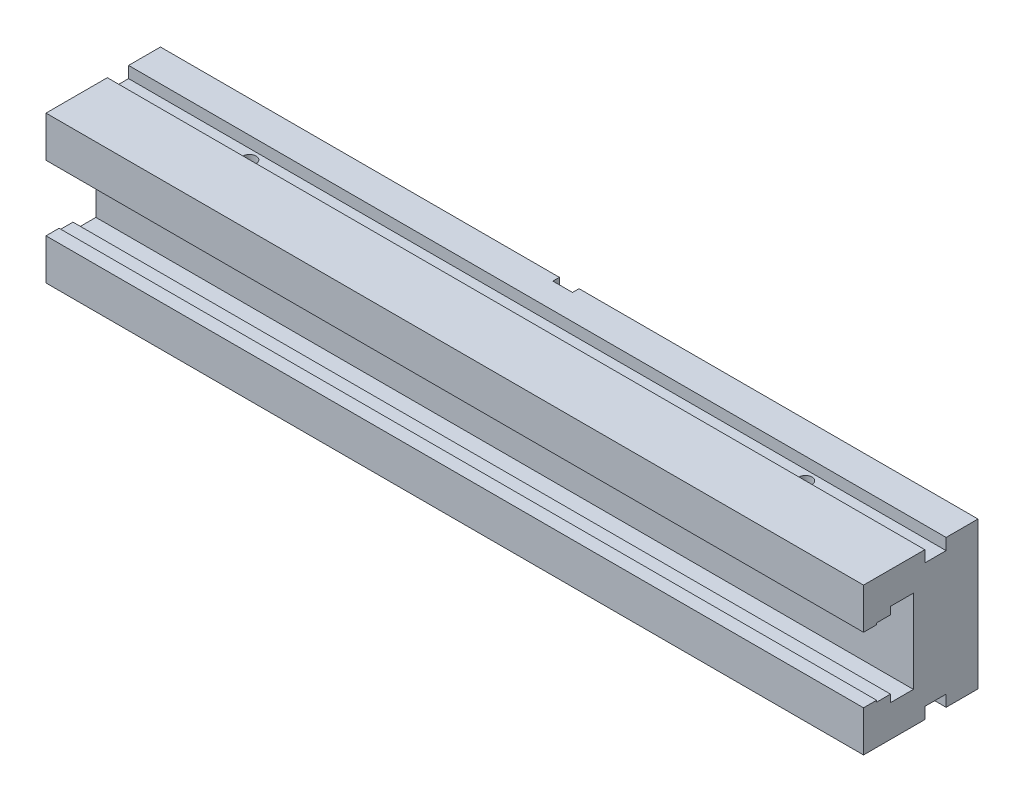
ISO-10303-21;
HEADER;
FILE_DESCRIPTION(('STEP AP214'),'2;1');
FILE_NAME('part.step','',(''),(''),'','','');
FILE_SCHEMA(('AUTOMOTIVE_DESIGN { 1 0 10303 214 1 1 1 1 }'));
ENDSEC;
DATA;
#1=APPLICATION_CONTEXT('core data for automotive mechanical design processes');
#2=APPLICATION_PROTOCOL_DEFINITION('international standard','automotive_design',2000,#1);
#3=PRODUCT_CONTEXT('',#1,'mechanical');
#4=PRODUCT('Part','Part','',(#3));
#5=PRODUCT_RELATED_PRODUCT_CATEGORY('part','',(#4));
#6=PRODUCT_DEFINITION_FORMATION('','',#4);
#7=PRODUCT_DEFINITION_CONTEXT('part definition',#1,'design');
#8=PRODUCT_DEFINITION('design','',#6,#7);
#9=PRODUCT_DEFINITION_SHAPE('','',#8);
#10=(LENGTH_UNIT() NAMED_UNIT(*) SI_UNIT(.MILLI.,.METRE.));
#11=(NAMED_UNIT(*) PLANE_ANGLE_UNIT() SI_UNIT($,.RADIAN.));
#12=(NAMED_UNIT(*) SI_UNIT($,.STERADIAN.) SOLID_ANGLE_UNIT());
#13=UNCERTAINTY_MEASURE_WITH_UNIT(LENGTH_MEASURE(1.E-05),#10,'distance_accuracy_value','');
#14=(GEOMETRIC_REPRESENTATION_CONTEXT(3) GLOBAL_UNCERTAINTY_ASSIGNED_CONTEXT((#13)) GLOBAL_UNIT_ASSIGNED_CONTEXT((#10,
#11,#12)) REPRESENTATION_CONTEXT('',''));
#15=CARTESIAN_POINT('',(0.,0.,0.));
#16=DIRECTION('',(0.,0.,1.));
#17=DIRECTION('',(1.,0.,0.));
#18=AXIS2_PLACEMENT_3D('',#15,#16,#17);
#19=CARTESIAN_POINT('',(250.,-45.,72.8382311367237));
#20=DIRECTION('',(0.,1.,0.));
#21=DIRECTION('',(0.,0.,1.));
#22=AXIS2_PLACEMENT_3D('',#19,#20,#21);
#23=PLANE('',#22);
#24=DIRECTION('',(0.,0.,-1.));
#25=VECTOR('',#24,1.);
#26=CARTESIAN_POINT('',(250.,-45.,72.8382311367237));
#27=LINE('',#26,#25);
#28=CARTESIAN_POINT('',(250.,-45.,19.5));
#29=VERTEX_POINT('',#28);
#30=CARTESIAN_POINT('',(250.,-45.,0.));
#31=VERTEX_POINT('',#30);
#32=EDGE_CURVE('E538',#29,#31,#27,.T.);
#33=ORIENTED_EDGE('',*,*,#32,.F.);
#34=DIRECTION('',(-1.,0.,0.));
#35=VECTOR('',#34,1.);
#36=CARTESIAN_POINT('',(250.,-45.,19.5));
#37=LINE('',#36,#35);
#38=CARTESIAN_POINT('',(-250.,-45.,19.5));
#39=VERTEX_POINT('',#38);
#40=EDGE_CURVE('E413',#29,#39,#37,.T.);
#41=ORIENTED_EDGE('',*,*,#40,.T.);
#42=DIRECTION('',(0.,0.,-1.));
#43=VECTOR('',#42,1.);
#44=CARTESIAN_POINT('',(-250.,-45.,0.));
#45=LINE('',#44,#43);
#46=CARTESIAN_POINT('',(-250.,-45.,0.));
#47=VERTEX_POINT('',#46);
#48=EDGE_CURVE('E338',#39,#47,#45,.T.);
#49=ORIENTED_EDGE('',*,*,#48,.T.);
#50=DIRECTION('',(-1.,0.,0.));
#51=VECTOR('',#50,1.);
#52=CARTESIAN_POINT('',(250.,-45.,0.));
#53=LINE('',#52,#51);
#54=CARTESIAN_POINT('',(-6.,-45.,0.));
#55=VERTEX_POINT('',#54);
#56=EDGE_CURVE('E542',#55,#47,#53,.T.);
#57=ORIENTED_EDGE('',*,*,#56,.F.);
#58=DIRECTION('',(0.,0.,1.));
#59=VECTOR('',#58,1.);
#60=CARTESIAN_POINT('',(-6.,-45.,72.8382311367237));
#61=LINE('',#60,#59);
#62=CARTESIAN_POINT('',(-6.,-45.,4.));
#63=VERTEX_POINT('',#62);
#64=EDGE_CURVE('E22',#55,#63,#61,.T.);
#65=ORIENTED_EDGE('',*,*,#64,.T.);
#66=DIRECTION('',(-1.,0.,0.));
#67=VECTOR('',#66,1.);
#68=CARTESIAN_POINT('',(250.,-45.,4.));
#69=LINE('',#68,#67);
#70=CARTESIAN_POINT('',(6.,-45.,4.));
#71=VERTEX_POINT('',#70);
#72=EDGE_CURVE('E346',#71,#63,#69,.T.);
#73=ORIENTED_EDGE('',*,*,#72,.F.);
#74=DIRECTION('',(0.,0.,-1.));
#75=VECTOR('',#74,1.);
#76=CARTESIAN_POINT('',(6.,-45.,72.8382311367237));
#77=LINE('',#76,#75);
#78=CARTESIAN_POINT('',(6.,-45.,0.));
#79=VERTEX_POINT('',#78);
#80=EDGE_CURVE('E342',#71,#79,#77,.T.);
#81=ORIENTED_EDGE('',*,*,#80,.T.);
#82=EDGE_CURVE('E543',#31,#79,#53,.T.);
#83=ORIENTED_EDGE('',*,*,#82,.F.);
#84=EDGE_LOOP('',(#33,#41,#49,#57,#65,#73,#81,#83));
#85=FACE_BOUND('',#84,.T.);
#86=ADVANCED_FACE('F14',(#85),#23,.F.);
#87=CARTESIAN_POINT('',(250.,19.9992262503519,70.0001190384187));
#88=DIRECTION('',(0.,1.,0.));
#89=DIRECTION('',(0.,0.,1.));
#90=AXIS2_PLACEMENT_3D('',#87,#88,#89);
#91=PLANE('',#90);
#92=DIRECTION('',(0.,0.,-1.));
#93=VECTOR('',#92,1.);
#94=CARTESIAN_POINT('',(-250.,19.9992262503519,70.0001190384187));
#95=LINE('',#94,#93);
#96=CARTESIAN_POINT('',(-250.,19.9992262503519,70.0001190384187));
#97=VERTEX_POINT('',#96);
#98=CARTESIAN_POINT('',(-250.,19.9992262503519,62.0007380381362));
#99=VERTEX_POINT('',#98);
#100=EDGE_CURVE('E586',#97,#99,#95,.T.);
#101=ORIENTED_EDGE('',*,*,#100,.T.);
#102=DIRECTION('',(-1.,0.,0.));
#103=VECTOR('',#102,1.);
#104=CARTESIAN_POINT('',(250.,19.9992262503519,62.0007380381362));
#105=LINE('',#104,#103);
#106=CARTESIAN_POINT('',(250.,19.9992262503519,62.0007380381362));
#107=VERTEX_POINT('',#106);
#108=EDGE_CURVE('E335',#107,#99,#105,.T.);
#109=ORIENTED_EDGE('',*,*,#108,.F.);
#110=DIRECTION('',(0.,0.,-1.));
#111=VECTOR('',#110,1.);
#112=CARTESIAN_POINT('',(250.,19.9992262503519,70.0001190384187));
#113=LINE('',#112,#111);
#114=CARTESIAN_POINT('',(250.,19.9992262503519,70.0001190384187));
#115=VERTEX_POINT('',#114);
#116=EDGE_CURVE('E619',#115,#107,#113,.T.);
#117=ORIENTED_EDGE('',*,*,#116,.F.);
#118=DIRECTION('',(-1.,0.,0.));
#119=VECTOR('',#118,1.);
#120=CARTESIAN_POINT('',(250.,19.9992262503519,70.0001190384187));
#121=LINE('',#120,#119);
#122=EDGE_CURVE('E297',#115,#97,#121,.T.);
#123=ORIENTED_EDGE('',*,*,#122,.T.);
#124=EDGE_LOOP('',(#101,#109,#117,#123));
#125=FACE_BOUND('',#124,.T.);
#126=ADVANCED_FACE('F16',(#125),#91,.F.);
#127=CARTESIAN_POINT('',(250.,19.9992262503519,62.0007380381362));
#128=DIRECTION('',(0.,0.,1.));
#129=DIRECTION('',(1.,0.,0.));
#130=AXIS2_PLACEMENT_3D('',#127,#128,#129);
#131=PLANE('',#130);
#132=DIRECTION('',(0.,1.,0.));
#133=VECTOR('',#132,1.);
#134=CARTESIAN_POINT('',(-250.,19.9992262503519,62.0007380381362));
#135=LINE('',#134,#133);
#136=CARTESIAN_POINT('',(-250.,21.0003392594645,62.0007380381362));
#137=VERTEX_POINT('',#136);
#138=EDGE_CURVE('E589',#99,#137,#135,.T.);
#139=ORIENTED_EDGE('',*,*,#138,.T.);
#140=DIRECTION('',(-1.,0.,0.));
#141=VECTOR('',#140,1.);
#142=CARTESIAN_POINT('',(250.,21.0003392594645,62.0007380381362));
#143=LINE('',#142,#141);
#144=CARTESIAN_POINT('',(250.,21.0003392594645,62.0007380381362));
#145=VERTEX_POINT('',#144);
#146=EDGE_CURVE('E332',#145,#137,#143,.T.);
#147=ORIENTED_EDGE('',*,*,#146,.F.);
#148=DIRECTION('',(0.,1.,0.));
#149=VECTOR('',#148,1.);
#150=CARTESIAN_POINT('',(250.,19.9992262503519,62.0007380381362));
#151=LINE('',#150,#149);
#152=EDGE_CURVE('E622',#107,#145,#151,.T.);
#153=ORIENTED_EDGE('',*,*,#152,.F.);
#154=ORIENTED_EDGE('',*,*,#108,.T.);
#155=EDGE_LOOP('',(#139,#147,#153,#154));
#156=FACE_BOUND('',#155,.T.);
#157=ADVANCED_FACE('F728',(#156),#131,.F.);
#158=CARTESIAN_POINT('',(250.,21.0003392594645,53.5002053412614));
#159=DIRECTION('',(0.,1.,0.));
#160=DIRECTION('',(-1.,0.,0.));
#161=AXIS2_PLACEMENT_3D('',#158,#159,#160);
#162=PLANE('',#161);
#163=DIRECTION('',(0.,0.,-1.));
#164=VECTOR('',#163,1.);
#165=CARTESIAN_POINT('',(-250.,21.0003392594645,53.5002053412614));
#166=LINE('',#165,#164);
#167=CARTESIAN_POINT('',(-250.,21.0003392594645,53.5002053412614));
#168=VERTEX_POINT('',#167);
#169=EDGE_CURVE('E591',#137,#168,#166,.T.);
#170=ORIENTED_EDGE('',*,*,#169,.T.);
#171=DIRECTION('',(-1.,0.,0.));
#172=VECTOR('',#171,1.);
#173=CARTESIAN_POINT('',(250.,21.0003392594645,53.5002053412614));
#174=LINE('',#173,#172);
#175=CARTESIAN_POINT('',(250.,21.0003392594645,53.5002053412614));
#176=VERTEX_POINT('',#175);
#177=EDGE_CURVE('E329',#176,#168,#174,.T.);
#178=ORIENTED_EDGE('',*,*,#177,.F.);
#179=DIRECTION('',(0.,0.,-1.));
#180=VECTOR('',#179,1.);
#181=CARTESIAN_POINT('',(250.,21.0003392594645,53.5002053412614));
#182=LINE('',#181,#180);
#183=EDGE_CURVE('E624',#145,#176,#182,.T.);
#184=ORIENTED_EDGE('',*,*,#183,.F.);
#185=ORIENTED_EDGE('',*,*,#146,.T.);
#186=EDGE_LOOP('',(#170,#178,#184,#185));
#187=FACE_BOUND('',#186,.T.);
#188=ADVANCED_FACE('F827',(#187),#162,.F.);
#189=CARTESIAN_POINT('',(250.,21.0003392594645,53.5002053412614));
#190=DIRECTION('',(0.,0.,1.));
#191=DIRECTION('',(1.,0.,0.));
#192=AXIS2_PLACEMENT_3D('',#189,#190,#191);
#193=PLANE('',#192);
#194=DIRECTION('',(0.,1.,0.));
#195=VECTOR('',#194,1.);
#196=CARTESIAN_POINT('',(-250.,21.0003392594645,53.5002053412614));
#197=LINE('',#196,#195);
#198=CARTESIAN_POINT('',(-250.,25.4999910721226,53.5002053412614));
#199=VERTEX_POINT('',#198);
#200=EDGE_CURVE('E593',#168,#199,#197,.T.);
#201=ORIENTED_EDGE('',*,*,#200,.T.);
#202=DIRECTION('',(-1.,0.,0.));
#203=VECTOR('',#202,1.);
#204=CARTESIAN_POINT('',(250.,25.4999910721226,53.5002053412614));
#205=LINE('',#204,#203);
#206=CARTESIAN_POINT('',(250.,25.4999910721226,53.5002053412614));
#207=VERTEX_POINT('',#206);
#208=EDGE_CURVE('E326',#207,#199,#205,.T.);
#209=ORIENTED_EDGE('',*,*,#208,.F.);
#210=DIRECTION('',(0.,1.,0.));
#211=VECTOR('',#210,1.);
#212=CARTESIAN_POINT('',(250.,21.0003392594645,53.5002053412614));
#213=LINE('',#212,#211);
#214=EDGE_CURVE('E626',#176,#207,#213,.T.);
#215=ORIENTED_EDGE('',*,*,#214,.F.);
#216=ORIENTED_EDGE('',*,*,#177,.T.);
#217=EDGE_LOOP('',(#201,#209,#215,#216));
#218=FACE_BOUND('',#217,.T.);
#219=ADVANCED_FACE('F823',(#218),#193,.F.);
#220=CARTESIAN_POINT('',(250.,25.4999910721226,53.5002053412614));
#221=DIRECTION('',(0.,1.,0.));
#222=DIRECTION('',(-1.,0.,0.));
#223=AXIS2_PLACEMENT_3D('',#220,#221,#222);
#224=PLANE('',#223);
#225=DIRECTION('',(0.,0.,-1.));
#226=VECTOR('',#225,1.);
#227=CARTESIAN_POINT('',(-250.,25.4999910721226,53.5002053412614));
#228=LINE('',#227,#226);
#229=CARTESIAN_POINT('',(-250.,25.4999910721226,39.4999434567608));
#230=VERTEX_POINT('',#229);
#231=EDGE_CURVE('E595',#199,#230,#228,.T.);
#232=ORIENTED_EDGE('',*,*,#231,.T.);
#233=DIRECTION('',(-1.,0.,0.));
#234=VECTOR('',#233,1.);
#235=CARTESIAN_POINT('',(250.,25.4999910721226,39.4999434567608));
#236=LINE('',#235,#234);
#237=CARTESIAN_POINT('',(250.,25.4999910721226,39.4999434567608));
#238=VERTEX_POINT('',#237);
#239=EDGE_CURVE('E323',#238,#230,#236,.T.);
#240=ORIENTED_EDGE('',*,*,#239,.F.);
#241=DIRECTION('',(0.,0.,-1.));
#242=VECTOR('',#241,1.);
#243=CARTESIAN_POINT('',(250.,25.4999910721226,53.5002053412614));
#244=LINE('',#243,#242);
#245=EDGE_CURVE('E628',#207,#238,#244,.T.);
#246=ORIENTED_EDGE('',*,*,#245,.F.);
#247=ORIENTED_EDGE('',*,*,#208,.T.);
#248=EDGE_LOOP('',(#232,#240,#246,#247));
#249=FACE_BOUND('',#248,.T.);
#250=ADVANCED_FACE('F819',(#249),#224,.F.);
#251=CARTESIAN_POINT('',(250.,25.4999910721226,39.4999434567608));
#252=DIRECTION('',(0.,0.,-1.));
#253=DIRECTION('',(-1.,0.,0.));
#254=AXIS2_PLACEMENT_3D('',#251,#252,#253);
#255=PLANE('',#254);
#256=CARTESIAN_POINT('',(-150.,0.,39.4999434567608));
#257=DIRECTION('',(0.,0.,1.));
#258=DIRECTION('',(1.,0.,0.));
#259=AXIS2_PLACEMENT_3D('',#256,#257,#258);
#260=CIRCLE('',#259,9.5);
#261=CARTESIAN_POINT('',(-140.5,0.,39.4999434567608));
#262=VERTEX_POINT('',#261);
#263=EDGE_CURVE('E562',#262,#262,#260,.T.);
#264=ORIENTED_EDGE('',*,*,#263,.F.);
#265=EDGE_LOOP('',(#264));
#266=FACE_BOUND('',#265,.T.);
#267=CARTESIAN_POINT('',(150.,0.,39.4999434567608));
#268=DIRECTION('',(0.,0.,1.));
#269=DIRECTION('',(1.,0.,0.));
#270=AXIS2_PLACEMENT_3D('',#267,#268,#269);
#271=CIRCLE('',#270,9.5);
#272=CARTESIAN_POINT('',(159.5,0.,39.4999434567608));
#273=VERTEX_POINT('',#272);
#274=EDGE_CURVE('E574',#273,#273,#271,.T.);
#275=ORIENTED_EDGE('',*,*,#274,.F.);
#276=EDGE_LOOP('',(#275));
#277=FACE_BOUND('',#276,.T.);
#278=CARTESIAN_POINT('',(0.,0.,39.4999434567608));
#279=DIRECTION('',(0.,0.,1.));
#280=DIRECTION('',(1.,0.,0.));
#281=AXIS2_PLACEMENT_3D('',#278,#279,#280);
#282=CIRCLE('',#281,9.5);
#283=CARTESIAN_POINT('',(9.5,0.,39.4999434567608));
#284=VERTEX_POINT('',#283);
#285=EDGE_CURVE('E583',#284,#284,#282,.T.);
#286=ORIENTED_EDGE('',*,*,#285,.F.);
#287=EDGE_LOOP('',(#286));
#288=FACE_BOUND('',#287,.T.);
#289=DIRECTION('',(0.,-1.,0.));
#290=VECTOR('',#289,1.);
#291=CARTESIAN_POINT('',(-250.,25.4999910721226,39.4999434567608));
#292=LINE('',#291,#290);
#293=CARTESIAN_POINT('',(-250.,-25.4999910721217,39.4999434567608));
#294=VERTEX_POINT('',#293);
#295=EDGE_CURVE('E597',#230,#294,#292,.T.);
#296=ORIENTED_EDGE('',*,*,#295,.T.);
#297=DIRECTION('',(-1.,0.,0.));
#298=VECTOR('',#297,1.);
#299=CARTESIAN_POINT('',(250.,-25.4999910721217,39.4999434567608));
#300=LINE('',#299,#298);
#301=CARTESIAN_POINT('',(250.,-25.4999910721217,39.4999434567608));
#302=VERTEX_POINT('',#301);
#303=EDGE_CURVE('E320',#302,#294,#300,.T.);
#304=ORIENTED_EDGE('',*,*,#303,.F.);
#305=DIRECTION('',(0.,-1.,0.));
#306=VECTOR('',#305,1.);
#307=CARTESIAN_POINT('',(250.,25.4999910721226,39.4999434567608));
#308=LINE('',#307,#306);
#309=EDGE_CURVE('E630',#238,#302,#308,.T.);
#310=ORIENTED_EDGE('',*,*,#309,.F.);
#311=ORIENTED_EDGE('',*,*,#239,.T.);
#312=EDGE_LOOP('',(#296,#304,#310,#311));
#313=FACE_BOUND('',#312,.T.);
#314=ADVANCED_FACE('F815',(#266,#277,#288,#313),#255,.F.);
#315=CARTESIAN_POINT('',(250.,-25.4999910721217,39.4999434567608));
#316=DIRECTION('',(0.,-1.,0.));
#317=DIRECTION('',(1.,0.,0.));
#318=AXIS2_PLACEMENT_3D('',#315,#316,#317);
#319=PLANE('',#318);
#320=DIRECTION('',(0.,0.,1.));
#321=VECTOR('',#320,1.);
#322=CARTESIAN_POINT('',(-250.,-25.4999910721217,39.4999434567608));
#323=LINE('',#322,#321);
#324=CARTESIAN_POINT('',(-250.,-25.4999910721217,53.5002053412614));
#325=VERTEX_POINT('',#324);
#326=EDGE_CURVE('E599',#294,#325,#323,.T.);
#327=ORIENTED_EDGE('',*,*,#326,.T.);
#328=DIRECTION('',(-1.,0.,0.));
#329=VECTOR('',#328,1.);
#330=CARTESIAN_POINT('',(250.,-25.4999910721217,53.5002053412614));
#331=LINE('',#330,#329);
#332=CARTESIAN_POINT('',(250.,-25.4999910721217,53.5002053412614));
#333=VERTEX_POINT('',#332);
#334=EDGE_CURVE('E317',#333,#325,#331,.T.);
#335=ORIENTED_EDGE('',*,*,#334,.F.);
#336=DIRECTION('',(0.,0.,1.));
#337=VECTOR('',#336,1.);
#338=CARTESIAN_POINT('',(250.,-25.4999910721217,39.4999434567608));
#339=LINE('',#338,#337);
#340=EDGE_CURVE('E632',#302,#333,#339,.T.);
#341=ORIENTED_EDGE('',*,*,#340,.F.);
#342=ORIENTED_EDGE('',*,*,#303,.T.);
#343=EDGE_LOOP('',(#327,#335,#341,#342));
#344=FACE_BOUND('',#343,.T.);
#345=ADVANCED_FACE('F811',(#344),#319,.F.);
#346=CARTESIAN_POINT('',(250.,-25.4999910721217,53.5002053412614));
#347=DIRECTION('',(0.,0.,1.));
#348=DIRECTION('',(1.,0.,0.));
#349=AXIS2_PLACEMENT_3D('',#346,#347,#348);
#350=PLANE('',#349);
#351=DIRECTION('',(0.,1.,0.));
#352=VECTOR('',#351,1.);
#353=CARTESIAN_POINT('',(-250.,-25.4999910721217,53.5002053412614));
#354=LINE('',#353,#352);
#355=CARTESIAN_POINT('',(-250.,-21.0003392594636,53.5002053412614));
#356=VERTEX_POINT('',#355);
#357=EDGE_CURVE('E601',#325,#356,#354,.T.);
#358=ORIENTED_EDGE('',*,*,#357,.T.);
#359=DIRECTION('',(-1.,0.,0.));
#360=VECTOR('',#359,1.);
#361=CARTESIAN_POINT('',(250.,-21.0003392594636,53.5002053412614));
#362=LINE('',#361,#360);
#363=CARTESIAN_POINT('',(250.,-21.0003392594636,53.5002053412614));
#364=VERTEX_POINT('',#363);
#365=EDGE_CURVE('E314',#364,#356,#362,.T.);
#366=ORIENTED_EDGE('',*,*,#365,.F.);
#367=DIRECTION('',(0.,1.,0.));
#368=VECTOR('',#367,1.);
#369=CARTESIAN_POINT('',(250.,-25.4999910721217,53.5002053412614));
#370=LINE('',#369,#368);
#371=EDGE_CURVE('E634',#333,#364,#370,.T.);
#372=ORIENTED_EDGE('',*,*,#371,.F.);
#373=ORIENTED_EDGE('',*,*,#334,.T.);
#374=EDGE_LOOP('',(#358,#366,#372,#373));
#375=FACE_BOUND('',#374,.T.);
#376=ADVANCED_FACE('F807',(#375),#350,.F.);
#377=CARTESIAN_POINT('',(250.,-21.0003392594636,53.5002053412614));
#378=DIRECTION('',(0.,-1.,0.));
#379=DIRECTION('',(1.,0.,0.));
#380=AXIS2_PLACEMENT_3D('',#377,#378,#379);
#381=PLANE('',#380);
#382=DIRECTION('',(0.,0.,1.));
#383=VECTOR('',#382,1.);
#384=CARTESIAN_POINT('',(-250.,-21.0003392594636,53.5002053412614));
#385=LINE('',#384,#383);
#386=CARTESIAN_POINT('',(-250.,-21.0003392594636,62.0007380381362));
#387=VERTEX_POINT('',#386);
#388=EDGE_CURVE('E603',#356,#387,#385,.T.);
#389=ORIENTED_EDGE('',*,*,#388,.T.);
#390=DIRECTION('',(-1.,0.,0.));
#391=VECTOR('',#390,1.);
#392=CARTESIAN_POINT('',(250.,-21.0003392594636,62.0007380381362));
#393=LINE('',#392,#391);
#394=CARTESIAN_POINT('',(250.,-21.0003392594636,62.0007380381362));
#395=VERTEX_POINT('',#394);
#396=EDGE_CURVE('E311',#395,#387,#393,.T.);
#397=ORIENTED_EDGE('',*,*,#396,.F.);
#398=DIRECTION('',(0.,0.,1.));
#399=VECTOR('',#398,1.);
#400=CARTESIAN_POINT('',(250.,-21.0003392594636,53.5002053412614));
#401=LINE('',#400,#399);
#402=EDGE_CURVE('E636',#364,#395,#401,.T.);
#403=ORIENTED_EDGE('',*,*,#402,.F.);
#404=ORIENTED_EDGE('',*,*,#365,.T.);
#405=EDGE_LOOP('',(#389,#397,#403,#404));
#406=FACE_BOUND('',#405,.T.);
#407=ADVANCED_FACE('F803',(#406),#381,.F.);
#408=CARTESIAN_POINT('',(250.,-20.0004166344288,62.0007380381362));
#409=DIRECTION('',(0.,0.,1.));
#410=DIRECTION('',(1.,0.,0.));
#411=AXIS2_PLACEMENT_3D('',#408,#409,#410);
#412=PLANE('',#411);
#413=DIRECTION('',(0.,1.,0.));
#414=VECTOR('',#413,1.);
#415=CARTESIAN_POINT('',(-250.,-20.0004166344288,62.0007380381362));
#416=LINE('',#415,#414);
#417=CARTESIAN_POINT('',(-250.,-20.0004166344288,62.0007380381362));
#418=VERTEX_POINT('',#417);
#419=EDGE_CURVE('E605',#387,#418,#416,.T.);
#420=ORIENTED_EDGE('',*,*,#419,.T.);
#421=DIRECTION('',(-1.,0.,0.));
#422=VECTOR('',#421,1.);
#423=CARTESIAN_POINT('',(250.,-20.0004166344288,62.0007380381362));
#424=LINE('',#423,#422);
#425=CARTESIAN_POINT('',(250.,-20.0004166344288,62.0007380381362));
#426=VERTEX_POINT('',#425);
#427=EDGE_CURVE('E308',#426,#418,#424,.T.);
#428=ORIENTED_EDGE('',*,*,#427,.F.);
#429=DIRECTION('',(0.,1.,0.));
#430=VECTOR('',#429,1.);
#431=CARTESIAN_POINT('',(250.,-20.0004166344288,62.0007380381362));
#432=LINE('',#431,#430);
#433=EDGE_CURVE('E638',#395,#426,#432,.T.);
#434=ORIENTED_EDGE('',*,*,#433,.F.);
#435=ORIENTED_EDGE('',*,*,#396,.T.);
#436=EDGE_LOOP('',(#420,#428,#434,#435));
#437=FACE_BOUND('',#436,.T.);
#438=ADVANCED_FACE('F799',(#437),#412,.F.);
#439=CARTESIAN_POINT('',(250.,-20.0004166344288,62.0007380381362));
#440=DIRECTION('',(0.,-1.,0.));
#441=DIRECTION('',(1.,0.,0.));
#442=AXIS2_PLACEMENT_3D('',#439,#440,#441);
#443=PLANE('',#442);
#444=DIRECTION('',(0.,0.,1.));
#445=VECTOR('',#444,1.);
#446=CARTESIAN_POINT('',(-250.,-20.0004166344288,62.0007380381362));
#447=LINE('',#446,#445);
#448=CARTESIAN_POINT('',(-250.,-20.0004166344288,70.0001190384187));
#449=VERTEX_POINT('',#448);
#450=EDGE_CURVE('E607',#418,#449,#447,.T.);
#451=ORIENTED_EDGE('',*,*,#450,.T.);
#452=DIRECTION('',(-1.,0.,0.));
#453=VECTOR('',#452,1.);
#454=CARTESIAN_POINT('',(250.,-20.0004166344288,70.0001190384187));
#455=LINE('',#454,#453);
#456=CARTESIAN_POINT('',(250.,-20.0004166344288,70.0001190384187));
#457=VERTEX_POINT('',#456);
#458=EDGE_CURVE('E305',#457,#449,#455,.T.);
#459=ORIENTED_EDGE('',*,*,#458,.F.);
#460=DIRECTION('',(0.,0.,1.));
#461=VECTOR('',#460,1.);
#462=CARTESIAN_POINT('',(250.,-20.0004166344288,62.0007380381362));
#463=LINE('',#462,#461);
#464=EDGE_CURVE('E640',#426,#457,#463,.T.);
#465=ORIENTED_EDGE('',*,*,#464,.F.);
#466=ORIENTED_EDGE('',*,*,#427,.T.);
#467=EDGE_LOOP('',(#451,#459,#465,#466));
#468=FACE_BOUND('',#467,.T.);
#469=ADVANCED_FACE('F796',(#468),#443,.F.);
#470=CARTESIAN_POINT('',(250.,-45.0012499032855,70.0001190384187));
#471=DIRECTION('',(0.,0.,-1.));
#472=DIRECTION('',(-1.,0.,0.));
#473=AXIS2_PLACEMENT_3D('',#470,#471,#472);
#474=PLANE('',#473);
#475=DIRECTION('',(0.,-1.,0.));
#476=VECTOR('',#475,1.);
#477=CARTESIAN_POINT('',(-250.,-45.0012499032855,70.0001190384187));
#478=LINE('',#477,#476);
#479=CARTESIAN_POINT('',(-250.,-45.,70.0001190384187));
#480=VERTEX_POINT('',#479);
#481=EDGE_CURVE('E609',#449,#480,#478,.T.);
#482=ORIENTED_EDGE('',*,*,#481,.T.);
#483=DIRECTION('',(1.,0.,0.));
#484=VECTOR('',#483,1.);
#485=CARTESIAN_POINT('',(250.,-45.,70.0001190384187));
#486=LINE('',#485,#484);
#487=CARTESIAN_POINT('',(250.,-45.,70.0001190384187));
#488=VERTEX_POINT('',#487);
#489=EDGE_CURVE('E546',#480,#488,#486,.T.);
#490=ORIENTED_EDGE('',*,*,#489,.T.);
#491=DIRECTION('',(0.,-1.,0.));
#492=VECTOR('',#491,1.);
#493=CARTESIAN_POINT('',(250.,-45.0012499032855,70.0001190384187));
#494=LINE('',#493,#492);
#495=EDGE_CURVE('E299',#457,#488,#494,.T.);
#496=ORIENTED_EDGE('',*,*,#495,.F.);
#497=ORIENTED_EDGE('',*,*,#458,.T.);
#498=EDGE_LOOP('',(#482,#490,#496,#497));
#499=FACE_BOUND('',#498,.T.);
#500=ADVANCED_FACE('F646',(#499),#474,.F.);
#501=CARTESIAN_POINT('',(250.,45.0000595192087,0.));
#502=DIRECTION('',(0.,0.,1.));
#503=DIRECTION('',(1.,0.,0.));
#504=AXIS2_PLACEMENT_3D('',#501,#502,#503);
#505=PLANE('',#504);
#506=DIRECTION('',(-1.,0.,0.));
#507=VECTOR('',#506,1.);
#508=CARTESIAN_POINT('',(200.,-6.,0.));
#509=LINE('',#508,#507);
#510=CARTESIAN_POINT('',(200.,-6.,0.));
#511=VERTEX_POINT('',#510);
#512=CARTESIAN_POINT('',(170.,-6.,0.));
#513=VERTEX_POINT('',#512);
#514=EDGE_CURVE('E459',#511,#513,#509,.T.);
#515=ORIENTED_EDGE('',*,*,#514,.F.);
#516=CARTESIAN_POINT('',(200.,0.,0.));
#517=DIRECTION('',(0.,0.,-1.));
#518=DIRECTION('',(-1.,0.,0.));
#519=AXIS2_PLACEMENT_3D('',#516,#517,#518);
#520=CIRCLE('',#519,6.);
#521=CARTESIAN_POINT('',(200.,6.,0.));
#522=VERTEX_POINT('',#521);
#523=EDGE_CURVE('E457',#522,#511,#520,.T.);
#524=ORIENTED_EDGE('',*,*,#523,.F.);
#525=DIRECTION('',(1.,0.,0.));
#526=VECTOR('',#525,1.);
#527=CARTESIAN_POINT('',(200.,6.,0.));
#528=LINE('',#527,#526);
#529=CARTESIAN_POINT('',(170.,6.,0.));
#530=VERTEX_POINT('',#529);
#531=EDGE_CURVE('E447',#530,#522,#528,.T.);
#532=ORIENTED_EDGE('',*,*,#531,.F.);
#533=CARTESIAN_POINT('',(170.,0.,0.));
#534=DIRECTION('',(0.,0.,-1.));
#535=DIRECTION('',(-1.,0.,0.));
#536=AXIS2_PLACEMENT_3D('',#533,#534,#535);
#537=CIRCLE('',#536,6.);
#538=EDGE_CURVE('E463',#513,#530,#537,.T.);
#539=ORIENTED_EDGE('',*,*,#538,.F.);
#540=EDGE_LOOP('',(#515,#524,#532,#539));
#541=FACE_BOUND('',#540,.T.);
#542=DIRECTION('',(1.,0.,0.));
#543=VECTOR('',#542,1.);
#544=CARTESIAN_POINT('',(-200.,6.,0.));
#545=LINE('',#544,#543);
#546=CARTESIAN_POINT('',(-200.,6.,0.));
#547=VERTEX_POINT('',#546);
#548=CARTESIAN_POINT('',(-170.,6.,0.));
#549=VERTEX_POINT('',#548);
#550=EDGE_CURVE('E490',#547,#549,#545,.T.);
#551=ORIENTED_EDGE('',*,*,#550,.F.);
#552=CARTESIAN_POINT('',(-200.,0.,0.));
#553=DIRECTION('',(0.,0.,-1.));
#554=DIRECTION('',(-1.,0.,0.));
#555=AXIS2_PLACEMENT_3D('',#552,#553,#554);
#556=CIRCLE('',#555,6.);
#557=CARTESIAN_POINT('',(-200.,-6.,0.));
#558=VERTEX_POINT('',#557);
#559=EDGE_CURVE('E416',#558,#547,#556,.T.);
#560=ORIENTED_EDGE('',*,*,#559,.F.);
#561=DIRECTION('',(-1.,0.,0.));
#562=VECTOR('',#561,1.);
#563=CARTESIAN_POINT('',(-200.,-6.,0.));
#564=LINE('',#563,#562);
#565=CARTESIAN_POINT('',(-170.,-6.,0.));
#566=VERTEX_POINT('',#565);
#567=EDGE_CURVE('E479',#566,#558,#564,.T.);
#568=ORIENTED_EDGE('',*,*,#567,.F.);
#569=CARTESIAN_POINT('',(-170.,0.,0.));
#570=DIRECTION('',(0.,0.,-1.));
#571=DIRECTION('',(-1.,0.,0.));
#572=AXIS2_PLACEMENT_3D('',#569,#570,#571);
#573=CIRCLE('',#572,6.);
#574=EDGE_CURVE('E493',#549,#566,#573,.T.);
#575=ORIENTED_EDGE('',*,*,#574,.F.);
#576=EDGE_LOOP('',(#551,#560,#568,#575));
#577=FACE_BOUND('',#576,.T.);
#578=CARTESIAN_POINT('',(0.,0.,-4.27435864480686E-11));
#579=DIRECTION('',(0.,0.,1.));
#580=DIRECTION('',(1.,0.,0.));
#581=AXIS2_PLACEMENT_3D('',#578,#579,#580);
#582=CIRCLE('',#581,6.5);
#583=CARTESIAN_POINT('',(6.5,0.,-4.27435864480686E-11));
#584=VERTEX_POINT('',#583);
#585=EDGE_CURVE('E535',#584,#584,#582,.T.);
#586=ORIENTED_EDGE('',*,*,#585,.T.);
#587=EDGE_LOOP('',(#586));
#588=FACE_BOUND('',#587,.T.);
#589=CARTESIAN_POINT('',(150.,0.,-4.27435864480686E-11));
#590=DIRECTION('',(0.,0.,1.));
#591=DIRECTION('',(1.,0.,0.));
#592=AXIS2_PLACEMENT_3D('',#589,#590,#591);
#593=CIRCLE('',#592,6.5);
#594=CARTESIAN_POINT('',(156.5,0.,-4.27435864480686E-11));
#595=VERTEX_POINT('',#594);
#596=EDGE_CURVE('E565',#595,#595,#593,.T.);
#597=ORIENTED_EDGE('',*,*,#596,.T.);
#598=EDGE_LOOP('',(#597));
#599=FACE_BOUND('',#598,.T.);
#600=CARTESIAN_POINT('',(-150.,0.,-4.27435864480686E-11));
#601=DIRECTION('',(0.,0.,1.));
#602=DIRECTION('',(1.,0.,0.));
#603=AXIS2_PLACEMENT_3D('',#600,#601,#602);
#604=CIRCLE('',#603,6.5);
#605=CARTESIAN_POINT('',(-143.5,0.,-4.27435864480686E-11));
#606=VERTEX_POINT('',#605);
#607=EDGE_CURVE('E552',#606,#606,#604,.T.);
#608=ORIENTED_EDGE('',*,*,#607,.T.);
#609=EDGE_LOOP('',(#608));
#610=FACE_BOUND('',#609,.T.);
#611=DIRECTION('',(0.,1.,0.));
#612=VECTOR('',#611,1.);
#613=CARTESIAN_POINT('',(-250.,45.0000595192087,0.));
#614=LINE('',#613,#612);
#615=CARTESIAN_POINT('',(-250.,45.,0.));
#616=VERTEX_POINT('',#615);
#617=EDGE_CURVE('E612',#47,#616,#614,.T.);
#618=ORIENTED_EDGE('',*,*,#617,.T.);
#619=DIRECTION('',(1.,0.,0.));
#620=VECTOR('',#619,1.);
#621=CARTESIAN_POINT('',(250.,45.,0.));
#622=LINE('',#621,#620);
#623=CARTESIAN_POINT('',(-6.,45.,0.));
#624=VERTEX_POINT('',#623);
#625=EDGE_CURVE('E393',#616,#624,#622,.T.);
#626=ORIENTED_EDGE('',*,*,#625,.T.);
#627=DIRECTION('',(0.,1.,0.));
#628=VECTOR('',#627,1.);
#629=CARTESIAN_POINT('',(-6.,17.5,0.));
#630=LINE('',#629,#628);
#631=CARTESIAN_POINT('',(-6.,17.5,0.));
#632=VERTEX_POINT('',#631);
#633=EDGE_CURVE('E435',#632,#624,#630,.T.);
#634=ORIENTED_EDGE('',*,*,#633,.F.);
#635=CARTESIAN_POINT('',(0.,17.5,0.));
#636=DIRECTION('',(0.,0.,-1.));
#637=DIRECTION('',(-1.,0.,0.));
#638=AXIS2_PLACEMENT_3D('',#635,#636,#637);
#639=CIRCLE('',#638,6.);
#640=CARTESIAN_POINT('',(6.,17.5,0.));
#641=VERTEX_POINT('',#640);
#642=EDGE_CURVE('E432',#641,#632,#639,.T.);
#643=ORIENTED_EDGE('',*,*,#642,.F.);
#644=DIRECTION('',(0.,-1.,0.));
#645=VECTOR('',#644,1.);
#646=CARTESIAN_POINT('',(6.,17.5,0.));
#647=LINE('',#646,#645);
#648=CARTESIAN_POINT('',(6.,45.,0.));
#649=VERTEX_POINT('',#648);
#650=EDGE_CURVE('E426',#649,#641,#647,.T.);
#651=ORIENTED_EDGE('',*,*,#650,.F.);
#652=CARTESIAN_POINT('',(250.,45.,0.));
#653=VERTEX_POINT('',#652);
#654=EDGE_CURVE('E391',#649,#653,#622,.T.);
#655=ORIENTED_EDGE('',*,*,#654,.T.);
#656=DIRECTION('',(0.,1.,0.));
#657=VECTOR('',#656,1.);
#658=CARTESIAN_POINT('',(250.,45.0000595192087,0.));
#659=LINE('',#658,#657);
#660=EDGE_CURVE('E288',#31,#653,#659,.T.);
#661=ORIENTED_EDGE('',*,*,#660,.F.);
#662=ORIENTED_EDGE('',*,*,#82,.T.);
#663=DIRECTION('',(0.,-1.,0.));
#664=VECTOR('',#663,1.);
#665=CARTESIAN_POINT('',(6.,-17.5,0.));
#666=LINE('',#665,#664);
#667=CARTESIAN_POINT('',(6.,-17.5,0.));
#668=VERTEX_POINT('',#667);
#669=EDGE_CURVE('E516',#668,#79,#666,.T.);
#670=ORIENTED_EDGE('',*,*,#669,.F.);
#671=CARTESIAN_POINT('',(0.,-17.5,0.));
#672=DIRECTION('',(0.,0.,-1.));
#673=DIRECTION('',(-1.,0.,0.));
#674=AXIS2_PLACEMENT_3D('',#671,#672,#673);
#675=CIRCLE('',#674,6.);
#676=CARTESIAN_POINT('',(-6.,-17.5,0.));
#677=VERTEX_POINT('',#676);
#678=EDGE_CURVE('E362',#677,#668,#675,.T.);
#679=ORIENTED_EDGE('',*,*,#678,.F.);
#680=DIRECTION('',(0.,1.,0.));
#681=VECTOR('',#680,1.);
#682=CARTESIAN_POINT('',(-6.,-17.5,0.));
#683=LINE('',#682,#681);
#684=EDGE_CURVE('E509',#55,#677,#683,.T.);
#685=ORIENTED_EDGE('',*,*,#684,.F.);
#686=ORIENTED_EDGE('',*,*,#56,.T.);
#687=EDGE_LOOP('',(#618,#626,#634,#643,#651,#655,#661,#662,#670,#679,#685,#686));
#688=FACE_BOUND('',#687,.T.);
#689=ADVANCED_FACE('F675',(#541,#577,#588,#599,#610,#688),#505,.F.);
#690=CARTESIAN_POINT('',(250.,45.0000595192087,19.5));
#691=DIRECTION('',(0.,0.,-1.));
#692=DIRECTION('',(-1.,0.,0.));
#693=AXIS2_PLACEMENT_3D('',#690,#691,#692);
#694=PLANE('',#693);
#695=DIRECTION('',(0.,-1.,0.));
#696=VECTOR('',#695,1.);
#697=CARTESIAN_POINT('',(250.,45.0000595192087,19.5));
#698=LINE('',#697,#696);
#699=CARTESIAN_POINT('',(250.,45.,19.5));
#700=VERTEX_POINT('',#699);
#701=CARTESIAN_POINT('',(250.,38.,19.5));
#702=VERTEX_POINT('',#701);
#703=EDGE_CURVE('E285',#700,#702,#698,.T.);
#704=ORIENTED_EDGE('',*,*,#703,.F.);
#705=DIRECTION('',(-1.,0.,0.));
#706=VECTOR('',#705,1.);
#707=CARTESIAN_POINT('',(250.,45.,19.5));
#708=LINE('',#707,#706);
#709=CARTESIAN_POINT('',(-250.,45.,19.5));
#710=VERTEX_POINT('',#709);
#711=EDGE_CURVE('E268',#700,#710,#708,.T.);
#712=ORIENTED_EDGE('',*,*,#711,.T.);
#713=DIRECTION('',(0.,-1.,0.));
#714=VECTOR('',#713,1.);
#715=CARTESIAN_POINT('',(-250.,45.0000595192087,19.5));
#716=LINE('',#715,#714);
#717=CARTESIAN_POINT('',(-250.,38.,19.5));
#718=VERTEX_POINT('',#717);
#719=EDGE_CURVE('E615',#710,#718,#716,.T.);
#720=ORIENTED_EDGE('',*,*,#719,.T.);
#721=DIRECTION('',(-1.,0.,0.));
#722=VECTOR('',#721,1.);
#723=CARTESIAN_POINT('',(250.,38.,19.5));
#724=LINE('',#723,#722);
#725=EDGE_CURVE('E278',#702,#718,#724,.T.);
#726=ORIENTED_EDGE('',*,*,#725,.F.);
#727=EDGE_LOOP('',(#704,#712,#720,#726));
#728=FACE_BOUND('',#727,.T.);
#729=ADVANCED_FACE('F292',(#728),#694,.F.);
#730=CARTESIAN_POINT('',(250.,19.9992262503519,70.0001190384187));
#731=DIRECTION('',(0.,0.,-1.));
#732=DIRECTION('',(-1.,0.,0.));
#733=AXIS2_PLACEMENT_3D('',#730,#731,#732);
#734=PLANE('',#733);
#735=DIRECTION('',(0.,-1.,0.));
#736=VECTOR('',#735,1.);
#737=CARTESIAN_POINT('',(250.,19.9992262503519,70.0001190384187));
#738=LINE('',#737,#736);
#739=CARTESIAN_POINT('',(250.,45.,70.0001190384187));
#740=VERTEX_POINT('',#739);
#741=EDGE_CURVE('E295',#740,#115,#738,.T.);
#742=ORIENTED_EDGE('',*,*,#741,.F.);
#743=DIRECTION('',(-1.,0.,0.));
#744=VECTOR('',#743,1.);
#745=CARTESIAN_POINT('',(250.,45.,70.0001190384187));
#746=LINE('',#745,#744);
#747=CARTESIAN_POINT('',(-250.,45.,70.0001190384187));
#748=VERTEX_POINT('',#747);
#749=EDGE_CURVE('E369',#740,#748,#746,.T.);
#750=ORIENTED_EDGE('',*,*,#749,.T.);
#751=DIRECTION('',(0.,-1.,0.));
#752=VECTOR('',#751,1.);
#753=CARTESIAN_POINT('',(-250.,19.9992262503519,70.0001190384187));
#754=LINE('',#753,#752);
#755=EDGE_CURVE('E617',#748,#97,#754,.T.);
#756=ORIENTED_EDGE('',*,*,#755,.T.);
#757=ORIENTED_EDGE('',*,*,#122,.F.);
#758=EDGE_LOOP('',(#742,#750,#756,#757));
#759=FACE_BOUND('',#758,.T.);
#760=ADVANCED_FACE('F785',(#759),#734,.F.);
#761=CARTESIAN_POINT('',(250.,19.9992262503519,0.));
#762=DIRECTION('',(-1.,0.,0.));
#763=DIRECTION('',(0.,-1.,0.));
#764=AXIS2_PLACEMENT_3D('',#761,#762,#763);
#765=PLANE('',#764);
#766=DIRECTION('',(0.,-1.,0.));
#767=VECTOR('',#766,1.);
#768=CARTESIAN_POINT('',(250.,38.0000595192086,32.5));
#769=LINE('',#768,#767);
#770=CARTESIAN_POINT('',(250.,45.,32.5));
#771=VERTEX_POINT('',#770);
#772=CARTESIAN_POINT('',(250.,38.,32.5));
#773=VERTEX_POINT('',#772);
#774=EDGE_CURVE('E550',#771,#773,#769,.T.);
#775=ORIENTED_EDGE('',*,*,#774,.F.);
#776=DIRECTION('',(0.,0.,1.));
#777=VECTOR('',#776,1.);
#778=CARTESIAN_POINT('',(250.,45.,76.7118489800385));
#779=LINE('',#778,#777);
#780=EDGE_CURVE('E29',#771,#740,#779,.T.);
#781=ORIENTED_EDGE('',*,*,#780,.T.);
#782=ORIENTED_EDGE('',*,*,#741,.T.);
#783=ORIENTED_EDGE('',*,*,#116,.T.);
#784=ORIENTED_EDGE('',*,*,#152,.T.);
#785=ORIENTED_EDGE('',*,*,#183,.T.);
#786=ORIENTED_EDGE('',*,*,#214,.T.);
#787=ORIENTED_EDGE('',*,*,#245,.T.);
#788=ORIENTED_EDGE('',*,*,#309,.T.);
#789=ORIENTED_EDGE('',*,*,#340,.T.);
#790=ORIENTED_EDGE('',*,*,#371,.T.);
#791=ORIENTED_EDGE('',*,*,#402,.T.);
#792=ORIENTED_EDGE('',*,*,#433,.T.);
#793=ORIENTED_EDGE('',*,*,#464,.T.);
#794=ORIENTED_EDGE('',*,*,#495,.T.);
#795=CARTESIAN_POINT('',(250.,-45.,32.5));
#796=VERTEX_POINT('',#795);
#797=EDGE_CURVE('E539',#488,#796,#27,.T.);
#798=ORIENTED_EDGE('',*,*,#797,.T.);
#799=DIRECTION('',(0.,1.,0.));
#800=VECTOR('',#799,1.);
#801=CARTESIAN_POINT('',(250.,-45.,32.5));
#802=LINE('',#801,#800);
#803=CARTESIAN_POINT('',(250.,-38.,32.5));
#804=VERTEX_POINT('',#803);
#805=EDGE_CURVE('E396',#796,#804,#802,.T.);
#806=ORIENTED_EDGE('',*,*,#805,.T.);
#807=DIRECTION('',(0.,0.,-1.));
#808=VECTOR('',#807,1.);
#809=CARTESIAN_POINT('',(250.,-38.,19.5));
#810=LINE('',#809,#808);
#811=CARTESIAN_POINT('',(250.,-38.,19.5));
#812=VERTEX_POINT('',#811);
#813=EDGE_CURVE('E399',#804,#812,#810,.T.);
#814=ORIENTED_EDGE('',*,*,#813,.T.);
#815=DIRECTION('',(0.,-1.,0.));
#816=VECTOR('',#815,1.);
#817=CARTESIAN_POINT('',(250.,-45.,19.5));
#818=LINE('',#817,#816);
#819=EDGE_CURVE('E403',#812,#29,#818,.T.);
#820=ORIENTED_EDGE('',*,*,#819,.T.);
#821=ORIENTED_EDGE('',*,*,#32,.T.);
#822=ORIENTED_EDGE('',*,*,#660,.T.);
#823=DIRECTION('',(0.,0.,1.));
#824=VECTOR('',#823,1.);
#825=CARTESIAN_POINT('',(250.,45.,19.5));
#826=LINE('',#825,#824);
#827=EDGE_CURVE('E271',#653,#700,#826,.T.);
#828=ORIENTED_EDGE('',*,*,#827,.T.);
#829=ORIENTED_EDGE('',*,*,#703,.T.);
#830=DIRECTION('',(0.,0.,1.));
#831=VECTOR('',#830,1.);
#832=CARTESIAN_POINT('',(250.,38.,32.5));
#833=LINE('',#832,#831);
#834=EDGE_CURVE('E289',#702,#773,#833,.T.);
#835=ORIENTED_EDGE('',*,*,#834,.T.);
#836=EDGE_LOOP('',(#775,#781,#782,#783,#784,#785,#786,#787,#788,#789,#790,#791,#792,#793,#794,
#798,#806,#814,#820,#821,#822,#828,#829,#835));
#837=FACE_BOUND('',#836,.T.);
#838=ADVANCED_FACE('F283',(#837),#765,.F.);
#839=CARTESIAN_POINT('',(-250.,19.9992262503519,0.));
#840=DIRECTION('',(-1.,0.,0.));
#841=DIRECTION('',(0.,-1.,0.));
#842=AXIS2_PLACEMENT_3D('',#839,#840,#841);
#843=PLANE('',#842);
#844=DIRECTION('',(0.,0.,1.));
#845=VECTOR('',#844,1.);
#846=CARTESIAN_POINT('',(-250.,45.,76.7118489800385));
#847=LINE('',#846,#845);
#848=CARTESIAN_POINT('',(-250.,45.,32.5));
#849=VERTEX_POINT('',#848);
#850=EDGE_CURVE('E290',#849,#748,#847,.T.);
#851=ORIENTED_EDGE('',*,*,#850,.F.);
#852=DIRECTION('',(0.,-1.,0.));
#853=VECTOR('',#852,1.);
#854=CARTESIAN_POINT('',(-250.,38.0000595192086,32.5));
#855=LINE('',#854,#853);
#856=CARTESIAN_POINT('',(-250.,38.,32.5));
#857=VERTEX_POINT('',#856);
#858=EDGE_CURVE('E549',#849,#857,#855,.T.);
#859=ORIENTED_EDGE('',*,*,#858,.T.);
#860=DIRECTION('',(0.,0.,1.));
#861=VECTOR('',#860,1.);
#862=CARTESIAN_POINT('',(-250.,38.,32.5));
#863=LINE('',#862,#861);
#864=EDGE_CURVE('E860',#718,#857,#863,.T.);
#865=ORIENTED_EDGE('',*,*,#864,.F.);
#866=ORIENTED_EDGE('',*,*,#719,.F.);
#867=DIRECTION('',(0.,0.,1.));
#868=VECTOR('',#867,1.);
#869=CARTESIAN_POINT('',(-250.,45.,19.5));
#870=LINE('',#869,#868);
#871=EDGE_CURVE('E274',#616,#710,#870,.T.);
#872=ORIENTED_EDGE('',*,*,#871,.F.);
#873=ORIENTED_EDGE('',*,*,#617,.F.);
#874=ORIENTED_EDGE('',*,*,#48,.F.);
#875=DIRECTION('',(0.,-1.,0.));
#876=VECTOR('',#875,1.);
#877=CARTESIAN_POINT('',(-250.,-45.,19.5));
#878=LINE('',#877,#876);
#879=CARTESIAN_POINT('',(-250.,-38.,19.5));
#880=VERTEX_POINT('',#879);
#881=EDGE_CURVE('E400',#880,#39,#878,.T.);
#882=ORIENTED_EDGE('',*,*,#881,.F.);
#883=DIRECTION('',(0.,0.,-1.));
#884=VECTOR('',#883,1.);
#885=CARTESIAN_POINT('',(-250.,-38.,19.5));
#886=LINE('',#885,#884);
#887=CARTESIAN_POINT('',(-250.,-38.,32.5));
#888=VERTEX_POINT('',#887);
#889=EDGE_CURVE('E409',#888,#880,#886,.T.);
#890=ORIENTED_EDGE('',*,*,#889,.F.);
#891=DIRECTION('',(0.,1.,0.));
#892=VECTOR('',#891,1.);
#893=CARTESIAN_POINT('',(-250.,-45.,32.5));
#894=LINE('',#893,#892);
#895=CARTESIAN_POINT('',(-250.,-45.,32.5));
#896=VERTEX_POINT('',#895);
#897=EDGE_CURVE('E366',#896,#888,#894,.T.);
#898=ORIENTED_EDGE('',*,*,#897,.F.);
#899=EDGE_CURVE('E339',#480,#896,#45,.T.);
#900=ORIENTED_EDGE('',*,*,#899,.F.);
#901=ORIENTED_EDGE('',*,*,#481,.F.);
#902=ORIENTED_EDGE('',*,*,#450,.F.);
#903=ORIENTED_EDGE('',*,*,#419,.F.);
#904=ORIENTED_EDGE('',*,*,#388,.F.);
#905=ORIENTED_EDGE('',*,*,#357,.F.);
#906=ORIENTED_EDGE('',*,*,#326,.F.);
#907=ORIENTED_EDGE('',*,*,#295,.F.);
#908=ORIENTED_EDGE('',*,*,#231,.F.);
#909=ORIENTED_EDGE('',*,*,#200,.F.);
#910=ORIENTED_EDGE('',*,*,#169,.F.);
#911=ORIENTED_EDGE('',*,*,#138,.F.);
#912=ORIENTED_EDGE('',*,*,#100,.F.);
#913=ORIENTED_EDGE('',*,*,#755,.F.);
#914=EDGE_LOOP('',(#851,#859,#865,#866,#872,#873,#874,#882,#890,#898,#900,#901,#902,#903,#904,
#905,#906,#907,#908,#909,#910,#911,#912,#913));
#915=FACE_BOUND('',#914,.T.);
#916=ADVANCED_FACE('F654',(#915),#843,.T.);
#917=CARTESIAN_POINT('',(0.,0.,39.4999434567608));
#918=DIRECTION('',(0.,0.,1.));
#919=DIRECTION('',(1.,0.,0.));
#920=AXIS2_PLACEMENT_3D('',#917,#918,#919);
#921=CYLINDRICAL_SURFACE('',#920,6.5);
#922=CARTESIAN_POINT('',(0.,0.,26.4999434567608));
#923=DIRECTION('',(0.,0.,1.));
#924=DIRECTION('',(1.,0.,0.));
#925=AXIS2_PLACEMENT_3D('',#922,#923,#924);
#926=CIRCLE('',#925,6.5);
#927=CARTESIAN_POINT('',(6.5,0.,26.4999434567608));
#928=VERTEX_POINT('',#927);
#929=EDGE_CURVE('E577',#928,#928,#926,.T.);
#930=ORIENTED_EDGE('',*,*,#929,.T.);
#931=EDGE_LOOP('',(#930));
#932=FACE_BOUND('',#931,.T.);
#933=ORIENTED_EDGE('',*,*,#585,.F.);
#934=EDGE_LOOP('',(#933));
#935=FACE_BOUND('',#934,.T.);
#936=ADVANCED_FACE('F770',(#932,#935),#921,.F.);
#937=CARTESIAN_POINT('',(0.,0.,39.4999434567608));
#938=DIRECTION('',(0.,0.,1.));
#939=DIRECTION('',(1.,0.,0.));
#940=AXIS2_PLACEMENT_3D('',#937,#938,#939);
#941=CYLINDRICAL_SURFACE('',#940,9.5);
#942=CARTESIAN_POINT('',(0.,0.,26.4999434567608));
#943=DIRECTION('',(0.,0.,1.));
#944=DIRECTION('',(1.,0.,0.));
#945=AXIS2_PLACEMENT_3D('',#942,#943,#944);
#946=CIRCLE('',#945,9.5);
#947=CARTESIAN_POINT('',(9.5,0.,26.4999434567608));
#948=VERTEX_POINT('',#947);
#949=EDGE_CURVE('E580',#948,#948,#946,.T.);
#950=ORIENTED_EDGE('',*,*,#949,.F.);
#951=EDGE_LOOP('',(#950));
#952=FACE_BOUND('',#951,.T.);
#953=ORIENTED_EDGE('',*,*,#285,.T.);
#954=EDGE_LOOP('',(#953));
#955=FACE_BOUND('',#954,.T.);
#956=ADVANCED_FACE('F773',(#952,#955),#941,.F.);
#957=CARTESIAN_POINT('',(0.,6.5,26.4999434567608));
#958=DIRECTION('',(0.,0.,-1.));
#959=DIRECTION('',(-1.,0.,0.));
#960=AXIS2_PLACEMENT_3D('',#957,#958,#959);
#961=PLANE('',#960);
#962=ORIENTED_EDGE('',*,*,#929,.F.);
#963=EDGE_LOOP('',(#962));
#964=FACE_BOUND('',#963,.T.);
#965=ORIENTED_EDGE('',*,*,#949,.T.);
#966=EDGE_LOOP('',(#965));
#967=FACE_BOUND('',#966,.T.);
#968=ADVANCED_FACE('F762',(#964,#967),#961,.F.);
#969=CARTESIAN_POINT('',(150.,0.,39.4999434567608));
#970=DIRECTION('',(0.,0.,1.));
#971=DIRECTION('',(1.,0.,0.));
#972=AXIS2_PLACEMENT_3D('',#969,#970,#971);
#973=CYLINDRICAL_SURFACE('',#972,6.5);
#974=CARTESIAN_POINT('',(150.,0.,26.4999434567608));
#975=DIRECTION('',(0.,0.,1.));
#976=DIRECTION('',(1.,0.,0.));
#977=AXIS2_PLACEMENT_3D('',#974,#975,#976);
#978=CIRCLE('',#977,6.5);
#979=CARTESIAN_POINT('',(156.5,0.,26.4999434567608));
#980=VERTEX_POINT('',#979);
#981=EDGE_CURVE('E568',#980,#980,#978,.T.);
#982=ORIENTED_EDGE('',*,*,#981,.T.);
#983=EDGE_LOOP('',(#982));
#984=FACE_BOUND('',#983,.T.);
#985=ORIENTED_EDGE('',*,*,#596,.F.);
#986=EDGE_LOOP('',(#985));
#987=FACE_BOUND('',#986,.T.);
#988=ADVANCED_FACE('F758',(#984,#987),#973,.F.);
#989=CARTESIAN_POINT('',(150.,0.,39.4999434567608));
#990=DIRECTION('',(0.,0.,1.));
#991=DIRECTION('',(1.,0.,0.));
#992=AXIS2_PLACEMENT_3D('',#989,#990,#991);
#993=CYLINDRICAL_SURFACE('',#992,9.5);
#994=CARTESIAN_POINT('',(150.,0.,26.4999434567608));
#995=DIRECTION('',(0.,0.,1.));
#996=DIRECTION('',(1.,0.,0.));
#997=AXIS2_PLACEMENT_3D('',#994,#995,#996);
#998=CIRCLE('',#997,9.5);
#999=CARTESIAN_POINT('',(159.5,0.,26.4999434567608));
#1000=VERTEX_POINT('',#999);
#1001=EDGE_CURVE('E571',#1000,#1000,#998,.T.);
#1002=ORIENTED_EDGE('',*,*,#1001,.F.);
#1003=EDGE_LOOP('',(#1002));
#1004=FACE_BOUND('',#1003,.T.);
#1005=ORIENTED_EDGE('',*,*,#274,.T.);
#1006=EDGE_LOOP('',(#1005));
#1007=FACE_BOUND('',#1006,.T.);
#1008=ADVANCED_FACE('F761',(#1004,#1007),#993,.F.);
#1009=CARTESIAN_POINT('',(150.,6.5,26.4999434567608));
#1010=DIRECTION('',(0.,0.,-1.));
#1011=DIRECTION('',(-1.,0.,0.));
#1012=AXIS2_PLACEMENT_3D('',#1009,#1010,#1011);
#1013=PLANE('',#1012);
#1014=ORIENTED_EDGE('',*,*,#981,.F.);
#1015=EDGE_LOOP('',(#1014));
#1016=FACE_BOUND('',#1015,.T.);
#1017=ORIENTED_EDGE('',*,*,#1001,.T.);
#1018=EDGE_LOOP('',(#1017));
#1019=FACE_BOUND('',#1018,.T.);
#1020=ADVANCED_FACE('F752',(#1016,#1019),#1013,.F.);
#1021=CARTESIAN_POINT('',(-150.,0.,39.4999434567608));
#1022=DIRECTION('',(0.,0.,1.));
#1023=DIRECTION('',(1.,0.,0.));
#1024=AXIS2_PLACEMENT_3D('',#1021,#1022,#1023);
#1025=CYLINDRICAL_SURFACE('',#1024,6.5);
#1026=CARTESIAN_POINT('',(-150.,0.,26.4999434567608));
#1027=DIRECTION('',(0.,0.,1.));
#1028=DIRECTION('',(1.,0.,0.));
#1029=AXIS2_PLACEMENT_3D('',#1026,#1027,#1028);
#1030=CIRCLE('',#1029,6.5);
#1031=CARTESIAN_POINT('',(-143.5,0.,26.4999434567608));
#1032=VERTEX_POINT('',#1031);
#1033=EDGE_CURVE('E556',#1032,#1032,#1030,.T.);
#1034=ORIENTED_EDGE('',*,*,#1033,.T.);
#1035=EDGE_LOOP('',(#1034));
#1036=FACE_BOUND('',#1035,.T.);
#1037=ORIENTED_EDGE('',*,*,#607,.F.);
#1038=EDGE_LOOP('',(#1037));
#1039=FACE_BOUND('',#1038,.T.);
#1040=ADVANCED_FACE('F750',(#1036,#1039),#1025,.F.);
#1041=CARTESIAN_POINT('',(-150.,0.,39.4999434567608));
#1042=DIRECTION('',(0.,0.,1.));
#1043=DIRECTION('',(1.,0.,0.));
#1044=AXIS2_PLACEMENT_3D('',#1041,#1042,#1043);
#1045=CYLINDRICAL_SURFACE('',#1044,9.5);
#1046=CARTESIAN_POINT('',(-150.,0.,26.4999434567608));
#1047=DIRECTION('',(0.,0.,1.));
#1048=DIRECTION('',(1.,0.,0.));
#1049=AXIS2_PLACEMENT_3D('',#1046,#1047,#1048);
#1050=CIRCLE('',#1049,9.5);
#1051=CARTESIAN_POINT('',(-140.5,0.,26.4999434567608));
#1052=VERTEX_POINT('',#1051);
#1053=EDGE_CURVE('E559',#1052,#1052,#1050,.T.);
#1054=ORIENTED_EDGE('',*,*,#1053,.F.);
#1055=EDGE_LOOP('',(#1054));
#1056=FACE_BOUND('',#1055,.T.);
#1057=ORIENTED_EDGE('',*,*,#263,.T.);
#1058=EDGE_LOOP('',(#1057));
#1059=FACE_BOUND('',#1058,.T.);
#1060=ADVANCED_FACE('F746',(#1056,#1059),#1045,.F.);
#1061=CARTESIAN_POINT('',(-150.,6.5,26.4999434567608));
#1062=DIRECTION('',(0.,0.,-1.));
#1063=DIRECTION('',(-1.,0.,0.));
#1064=AXIS2_PLACEMENT_3D('',#1061,#1062,#1063);
#1065=PLANE('',#1064);
#1066=ORIENTED_EDGE('',*,*,#1033,.F.);
#1067=EDGE_LOOP('',(#1066));
#1068=FACE_BOUND('',#1067,.T.);
#1069=ORIENTED_EDGE('',*,*,#1053,.T.);
#1070=EDGE_LOOP('',(#1069));
#1071=FACE_BOUND('',#1070,.T.);
#1072=ADVANCED_FACE('F740',(#1068,#1071),#1065,.F.);
#1073=CARTESIAN_POINT('',(250.,38.0000595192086,32.5));
#1074=DIRECTION('',(0.,0.,-1.));
#1075=DIRECTION('',(-1.,0.,0.));
#1076=AXIS2_PLACEMENT_3D('',#1073,#1074,#1075);
#1077=PLANE('',#1076);
#1078=DIRECTION('',(-1.,0.,0.));
#1079=VECTOR('',#1078,1.);
#1080=CARTESIAN_POINT('',(250.,45.,32.5));
#1081=LINE('',#1080,#1079);
#1082=EDGE_CURVE('E373',#771,#849,#1081,.T.);
#1083=ORIENTED_EDGE('',*,*,#1082,.F.);
#1084=ORIENTED_EDGE('',*,*,#774,.T.);
#1085=DIRECTION('',(-1.,0.,0.));
#1086=VECTOR('',#1085,1.);
#1087=CARTESIAN_POINT('',(250.,38.,32.5));
#1088=LINE('',#1087,#1086);
#1089=EDGE_CURVE('E379',#773,#857,#1088,.T.);
#1090=ORIENTED_EDGE('',*,*,#1089,.T.);
#1091=ORIENTED_EDGE('',*,*,#858,.F.);
#1092=EDGE_LOOP('',(#1083,#1084,#1090,#1091));
#1093=FACE_BOUND('',#1092,.T.);
#1094=ADVANCED_FACE('F733',(#1093),#1077,.T.);
#1095=ORIENTED_EDGE('',*,*,#899,.T.);
#1096=DIRECTION('',(-1.,0.,0.));
#1097=VECTOR('',#1096,1.);
#1098=CARTESIAN_POINT('',(250.,-45.,32.5));
#1099=LINE('',#1098,#1097);
#1100=EDGE_CURVE('E406',#796,#896,#1099,.T.);
#1101=ORIENTED_EDGE('',*,*,#1100,.F.);
#1102=ORIENTED_EDGE('',*,*,#797,.F.);
#1103=ORIENTED_EDGE('',*,*,#489,.F.);
#1104=EDGE_LOOP('',(#1095,#1101,#1102,#1103));
#1105=FACE_BOUND('',#1104,.T.);
#1106=ADVANCED_FACE('F650',(#1105),#23,.F.);
#1107=CARTESIAN_POINT('',(-6.,-17.5,4.));
#1108=DIRECTION('',(-1.,0.,0.));
#1109=DIRECTION('',(0.,-1.,0.));
#1110=AXIS2_PLACEMENT_3D('',#1107,#1108,#1109);
#1111=PLANE('',#1110);
#1112=ORIENTED_EDGE('',*,*,#684,.T.);
#1113=DIRECTION('',(0.,0.,-1.));
#1114=VECTOR('',#1113,1.);
#1115=CARTESIAN_POINT('',(-6.,-17.5,4.));
#1116=LINE('',#1115,#1114);
#1117=CARTESIAN_POINT('',(-6.,-17.5,4.));
#1118=VERTEX_POINT('',#1117);
#1119=EDGE_CURVE('E347',#1118,#677,#1116,.T.);
#1120=ORIENTED_EDGE('',*,*,#1119,.F.);
#1121=DIRECTION('',(0.,1.,0.));
#1122=VECTOR('',#1121,1.);
#1123=CARTESIAN_POINT('',(-6.,-17.5,4.));
#1124=LINE('',#1123,#1122);
#1125=EDGE_CURVE('E511',#63,#1118,#1124,.T.);
#1126=ORIENTED_EDGE('',*,*,#1125,.F.);
#1127=ORIENTED_EDGE('',*,*,#64,.F.);
#1128=EDGE_LOOP('',(#1112,#1120,#1126,#1127));
#1129=FACE_BOUND('',#1128,.T.);
#1130=ADVANCED_FACE('F682',(#1129),#1111,.F.);
#1131=CARTESIAN_POINT('',(6.,-17.5,4.));
#1132=DIRECTION('',(1.,0.,0.));
#1133=DIRECTION('',(0.,1.,0.));
#1134=AXIS2_PLACEMENT_3D('',#1131,#1132,#1133);
#1135=PLANE('',#1134);
#1136=DIRECTION('',(0.,-1.,0.));
#1137=VECTOR('',#1136,1.);
#1138=CARTESIAN_POINT('',(6.,-17.5,4.));
#1139=LINE('',#1138,#1137);
#1140=CARTESIAN_POINT('',(6.,-17.5,4.));
#1141=VERTEX_POINT('',#1140);
#1142=EDGE_CURVE('E508',#1141,#71,#1139,.T.);
#1143=ORIENTED_EDGE('',*,*,#1142,.F.);
#1144=DIRECTION('',(0.,0.,-1.));
#1145=VECTOR('',#1144,1.);
#1146=CARTESIAN_POINT('',(6.,-17.5,4.));
#1147=LINE('',#1146,#1145);
#1148=EDGE_CURVE('E513',#1141,#668,#1147,.T.);
#1149=ORIENTED_EDGE('',*,*,#1148,.T.);
#1150=ORIENTED_EDGE('',*,*,#669,.T.);
#1151=ORIENTED_EDGE('',*,*,#80,.F.);
#1152=EDGE_LOOP('',(#1143,#1149,#1150,#1151));
#1153=FACE_BOUND('',#1152,.T.);
#1154=ADVANCED_FACE('F690',(#1153),#1135,.F.);
#1155=CARTESIAN_POINT('',(0.,-17.5,4.));
#1156=DIRECTION('',(0.,0.,-1.));
#1157=DIRECTION('',(-1.,0.,0.));
#1158=AXIS2_PLACEMENT_3D('',#1155,#1156,#1157);
#1159=PLANE('',#1158);
#1160=CARTESIAN_POINT('',(0.,-32.5,4.));
#1161=DIRECTION('',(0.,0.,-1.));
#1162=DIRECTION('',(-1.,0.,0.));
#1163=AXIS2_PLACEMENT_3D('',#1160,#1161,#1162);
#1164=CIRCLE('',#1163,2.5);
#1165=CARTESIAN_POINT('',(-2.5,-32.5,4.));
#1166=VERTEX_POINT('',#1165);
#1167=EDGE_CURVE('E343',#1166,#1166,#1164,.F.);
#1168=ORIENTED_EDGE('',*,*,#1167,.T.);
#1169=EDGE_LOOP('',(#1168));
#1170=FACE_BOUND('',#1169,.T.);
#1171=ORIENTED_EDGE('',*,*,#72,.T.);
#1172=ORIENTED_EDGE('',*,*,#1125,.T.);
#1173=CARTESIAN_POINT('',(0.,-17.5,4.));
#1174=DIRECTION('',(0.,0.,-1.));
#1175=DIRECTION('',(-1.,0.,0.));
#1176=AXIS2_PLACEMENT_3D('',#1173,#1174,#1175);
#1177=CIRCLE('',#1176,6.);
#1178=EDGE_CURVE('E505',#1118,#1141,#1177,.T.);
#1179=ORIENTED_EDGE('',*,*,#1178,.T.);
#1180=ORIENTED_EDGE('',*,*,#1142,.T.);
#1181=EDGE_LOOP('',(#1171,#1172,#1179,#1180));
#1182=FACE_BOUND('',#1181,.T.);
#1183=ADVANCED_FACE('F686',(#1170,#1182),#1159,.T.);
#1184=CARTESIAN_POINT('',(0.,-17.5,4.));
#1185=DIRECTION('',(0.,0.,-1.));
#1186=DIRECTION('',(-1.,0.,0.));
#1187=AXIS2_PLACEMENT_3D('',#1184,#1185,#1186);
#1188=CYLINDRICAL_SURFACE('',#1187,6.);
#1189=ORIENTED_EDGE('',*,*,#678,.T.);
#1190=ORIENTED_EDGE('',*,*,#1148,.F.);
#1191=ORIENTED_EDGE('',*,*,#1178,.F.);
#1192=ORIENTED_EDGE('',*,*,#1119,.T.);
#1193=EDGE_LOOP('',(#1189,#1190,#1191,#1192));
#1194=FACE_BOUND('',#1193,.T.);
#1195=ADVANCED_FACE('F1269',(#1194),#1188,.F.);
#1196=CARTESIAN_POINT('',(0.,-32.5,24.));
#1197=DIRECTION('',(0.,0.,-1.));
#1198=DIRECTION('',(-1.,0.,0.));
#1199=AXIS2_PLACEMENT_3D('',#1196,#1197,#1198);
#1200=PLANE('',#1199);
#1201=CARTESIAN_POINT('',(0.,-32.5,24.));
#1202=DIRECTION('',(0.,0.,-1.));
#1203=DIRECTION('',(-1.,0.,0.));
#1204=AXIS2_PLACEMENT_3D('',#1201,#1202,#1203);
#1205=CIRCLE('',#1204,2.5);
#1206=CARTESIAN_POINT('',(-2.5,-32.5,24.));
#1207=VERTEX_POINT('',#1206);
#1208=EDGE_CURVE('E524',#1207,#1207,#1205,.T.);
#1209=ORIENTED_EDGE('',*,*,#1208,.T.);
#1210=EDGE_LOOP('',(#1209));
#1211=FACE_BOUND('',#1210,.T.);
#1212=ADVANCED_FACE('F1260',(#1211),#1200,.T.);
#1213=CARTESIAN_POINT('',(0.,-32.5,24.));
#1214=DIRECTION('',(0.,0.,-1.));
#1215=DIRECTION('',(-1.,0.,0.));
#1216=AXIS2_PLACEMENT_3D('',#1213,#1214,#1215);
#1217=CYLINDRICAL_SURFACE('',#1216,2.5);
#1218=ORIENTED_EDGE('',*,*,#1208,.F.);
#1219=EDGE_LOOP('',(#1218));
#1220=FACE_BOUND('',#1219,.T.);
#1221=ORIENTED_EDGE('',*,*,#1167,.F.);
#1222=EDGE_LOOP('',(#1221));
#1223=FACE_BOUND('',#1222,.T.);
#1224=ADVANCED_FACE('F1253',(#1220,#1223),#1217,.F.);
#1225=CARTESIAN_POINT('',(200.,0.,4.));
#1226=DIRECTION('',(0.,0.,-1.));
#1227=DIRECTION('',(-1.,0.,0.));
#1228=AXIS2_PLACEMENT_3D('',#1225,#1226,#1227);
#1229=PLANE('',#1228);
#1230=CARTESIAN_POINT('',(200.,0.,4.));
#1231=DIRECTION('',(0.,0.,-1.));
#1232=DIRECTION('',(-1.,0.,0.));
#1233=AXIS2_PLACEMENT_3D('',#1230,#1231,#1232);
#1234=CIRCLE('',#1233,6.);
#1235=CARTESIAN_POINT('',(200.,6.,4.));
#1236=VERTEX_POINT('',#1235);
#1237=CARTESIAN_POINT('',(200.,-6.,4.));
#1238=VERTEX_POINT('',#1237);
#1239=EDGE_CURVE('E443',#1236,#1238,#1234,.T.);
#1240=ORIENTED_EDGE('',*,*,#1239,.T.);
#1241=DIRECTION('',(-1.,0.,0.));
#1242=VECTOR('',#1241,1.);
#1243=CARTESIAN_POINT('',(200.,-6.,4.));
#1244=LINE('',#1243,#1242);
#1245=CARTESIAN_POINT('',(170.,-6.,4.));
#1246=VERTEX_POINT('',#1245);
#1247=EDGE_CURVE('E446',#1238,#1246,#1244,.T.);
#1248=ORIENTED_EDGE('',*,*,#1247,.T.);
#1249=CARTESIAN_POINT('',(170.,0.,4.));
#1250=DIRECTION('',(0.,0.,-1.));
#1251=DIRECTION('',(-1.,0.,0.));
#1252=AXIS2_PLACEMENT_3D('',#1249,#1250,#1251);
#1253=CIRCLE('',#1252,6.);
#1254=CARTESIAN_POINT('',(170.,6.,4.));
#1255=VERTEX_POINT('',#1254);
#1256=EDGE_CURVE('E450',#1246,#1255,#1253,.T.);
#1257=ORIENTED_EDGE('',*,*,#1256,.T.);
#1258=DIRECTION('',(1.,0.,0.));
#1259=VECTOR('',#1258,1.);
#1260=CARTESIAN_POINT('',(200.,6.,4.));
#1261=LINE('',#1260,#1259);
#1262=EDGE_CURVE('E453',#1255,#1236,#1261,.T.);
#1263=ORIENTED_EDGE('',*,*,#1262,.T.);
#1264=EDGE_LOOP('',(#1240,#1248,#1257,#1263));
#1265=FACE_BOUND('',#1264,.T.);
#1266=CARTESIAN_POINT('',(185.,0.,4.));
#1267=DIRECTION('',(0.,0.,-1.));
#1268=DIRECTION('',(-1.,0.,0.));
#1269=AXIS2_PLACEMENT_3D('',#1266,#1267,#1268);
#1270=CIRCLE('',#1269,2.5);
#1271=CARTESIAN_POINT('',(182.5,0.,4.));
#1272=VERTEX_POINT('',#1271);
#1273=EDGE_CURVE('E352',#1272,#1272,#1270,.F.);
#1274=ORIENTED_EDGE('',*,*,#1273,.T.);
#1275=EDGE_LOOP('',(#1274));
#1276=FACE_BOUND('',#1275,.T.);
#1277=ADVANCED_FACE('F1246',(#1265,#1276),#1229,.T.);
#1278=CARTESIAN_POINT('',(200.,0.,4.));
#1279=DIRECTION('',(0.,0.,-1.));
#1280=DIRECTION('',(-1.,0.,0.));
#1281=AXIS2_PLACEMENT_3D('',#1278,#1279,#1280);
#1282=CYLINDRICAL_SURFACE('',#1281,6.);
#1283=ORIENTED_EDGE('',*,*,#523,.T.);
#1284=DIRECTION('',(0.,0.,-1.));
#1285=VECTOR('',#1284,1.);
#1286=CARTESIAN_POINT('',(200.,-6.,4.));
#1287=LINE('',#1286,#1285);
#1288=EDGE_CURVE('E456',#1238,#511,#1287,.T.);
#1289=ORIENTED_EDGE('',*,*,#1288,.F.);
#1290=ORIENTED_EDGE('',*,*,#1239,.F.);
#1291=DIRECTION('',(0.,0.,-1.));
#1292=VECTOR('',#1291,1.);
#1293=CARTESIAN_POINT('',(200.,6.,4.));
#1294=LINE('',#1293,#1292);
#1295=EDGE_CURVE('E436',#1236,#522,#1294,.T.);
#1296=ORIENTED_EDGE('',*,*,#1295,.T.);
#1297=EDGE_LOOP('',(#1283,#1289,#1290,#1296));
#1298=FACE_BOUND('',#1297,.T.);
#1299=ADVANCED_FACE('F1238',(#1298),#1282,.F.);
#1300=CARTESIAN_POINT('',(200.,6.,4.));
#1301=DIRECTION('',(0.,1.,0.));
#1302=DIRECTION('',(-1.,0.,0.));
#1303=AXIS2_PLACEMENT_3D('',#1300,#1301,#1302);
#1304=PLANE('',#1303);
#1305=ORIENTED_EDGE('',*,*,#531,.T.);
#1306=ORIENTED_EDGE('',*,*,#1295,.F.);
#1307=ORIENTED_EDGE('',*,*,#1262,.F.);
#1308=DIRECTION('',(0.,0.,-1.));
#1309=VECTOR('',#1308,1.);
#1310=CARTESIAN_POINT('',(170.,6.,4.));
#1311=LINE('',#1310,#1309);
#1312=EDGE_CURVE('E469',#1255,#530,#1311,.T.);
#1313=ORIENTED_EDGE('',*,*,#1312,.T.);
#1314=EDGE_LOOP('',(#1305,#1306,#1307,#1313));
#1315=FACE_BOUND('',#1314,.T.);
#1316=ADVANCED_FACE('F1230',(#1315),#1304,.F.);
#1317=CARTESIAN_POINT('',(170.,0.,4.));
#1318=DIRECTION('',(0.,0.,-1.));
#1319=DIRECTION('',(-1.,0.,0.));
#1320=AXIS2_PLACEMENT_3D('',#1317,#1318,#1319);
#1321=CYLINDRICAL_SURFACE('',#1320,6.);
#1322=ORIENTED_EDGE('',*,*,#538,.T.);
#1323=ORIENTED_EDGE('',*,*,#1312,.F.);
#1324=ORIENTED_EDGE('',*,*,#1256,.F.);
#1325=DIRECTION('',(0.,0.,-1.));
#1326=VECTOR('',#1325,1.);
#1327=CARTESIAN_POINT('',(170.,-6.,4.));
#1328=LINE('',#1327,#1326);
#1329=EDGE_CURVE('E471',#1246,#513,#1328,.T.);
#1330=ORIENTED_EDGE('',*,*,#1329,.T.);
#1331=EDGE_LOOP('',(#1322,#1323,#1324,#1330));
#1332=FACE_BOUND('',#1331,.T.);
#1333=ADVANCED_FACE('F1222',(#1332),#1321,.F.);
#1334=CARTESIAN_POINT('',(200.,-6.,4.));
#1335=DIRECTION('',(0.,-1.,0.));
#1336=DIRECTION('',(1.,0.,0.));
#1337=AXIS2_PLACEMENT_3D('',#1334,#1335,#1336);
#1338=PLANE('',#1337);
#1339=ORIENTED_EDGE('',*,*,#514,.T.);
#1340=ORIENTED_EDGE('',*,*,#1329,.F.);
#1341=ORIENTED_EDGE('',*,*,#1247,.F.);
#1342=ORIENTED_EDGE('',*,*,#1288,.T.);
#1343=EDGE_LOOP('',(#1339,#1340,#1341,#1342));
#1344=FACE_BOUND('',#1343,.T.);
#1345=ADVANCED_FACE('F1213',(#1344),#1338,.F.);
#1346=CARTESIAN_POINT('',(-200.,0.,4.));
#1347=DIRECTION('',(0.,0.,-1.));
#1348=DIRECTION('',(-1.,0.,0.));
#1349=AXIS2_PLACEMENT_3D('',#1346,#1347,#1348);
#1350=PLANE('',#1349);
#1351=CARTESIAN_POINT('',(-200.,0.,4.));
#1352=DIRECTION('',(0.,0.,-1.));
#1353=DIRECTION('',(-1.,0.,0.));
#1354=AXIS2_PLACEMENT_3D('',#1351,#1352,#1353);
#1355=CIRCLE('',#1354,6.);
#1356=CARTESIAN_POINT('',(-200.,-6.,4.));
#1357=VERTEX_POINT('',#1356);
#1358=CARTESIAN_POINT('',(-200.,6.,4.));
#1359=VERTEX_POINT('',#1358);
#1360=EDGE_CURVE('E475',#1357,#1359,#1355,.T.);
#1361=ORIENTED_EDGE('',*,*,#1360,.T.);
#1362=DIRECTION('',(1.,0.,0.));
#1363=VECTOR('',#1362,1.);
#1364=CARTESIAN_POINT('',(-200.,6.,4.));
#1365=LINE('',#1364,#1363);
#1366=CARTESIAN_POINT('',(-170.,6.,4.));
#1367=VERTEX_POINT('',#1366);
#1368=EDGE_CURVE('E478',#1359,#1367,#1365,.T.);
#1369=ORIENTED_EDGE('',*,*,#1368,.T.);
#1370=CARTESIAN_POINT('',(-170.,0.,4.));
#1371=DIRECTION('',(0.,0.,-1.));
#1372=DIRECTION('',(-1.,0.,0.));
#1373=AXIS2_PLACEMENT_3D('',#1370,#1371,#1372);
#1374=CIRCLE('',#1373,6.);
#1375=CARTESIAN_POINT('',(-170.,-6.,4.));
#1376=VERTEX_POINT('',#1375);
#1377=EDGE_CURVE('E482',#1367,#1376,#1374,.T.);
#1378=ORIENTED_EDGE('',*,*,#1377,.T.);
#1379=DIRECTION('',(-1.,0.,0.));
#1380=VECTOR('',#1379,1.);
#1381=CARTESIAN_POINT('',(-200.,-6.,4.));
#1382=LINE('',#1381,#1380);
#1383=EDGE_CURVE('E485',#1376,#1357,#1382,.T.);
#1384=ORIENTED_EDGE('',*,*,#1383,.T.);
#1385=EDGE_LOOP('',(#1361,#1369,#1378,#1384));
#1386=FACE_BOUND('',#1385,.T.);
#1387=CARTESIAN_POINT('',(-185.,0.,4.));
#1388=DIRECTION('',(0.,0.,-1.));
#1389=DIRECTION('',(-1.,0.,0.));
#1390=AXIS2_PLACEMENT_3D('',#1387,#1388,#1389);
#1391=CIRCLE('',#1390,2.5);
#1392=CARTESIAN_POINT('',(-187.5,0.,4.));
#1393=VERTEX_POINT('',#1392);
#1394=EDGE_CURVE('E355',#1393,#1393,#1391,.F.);
#1395=ORIENTED_EDGE('',*,*,#1394,.T.);
#1396=EDGE_LOOP('',(#1395));
#1397=FACE_BOUND('',#1396,.T.);
#1398=ADVANCED_FACE('F1205',(#1386,#1397),#1350,.T.);
#1399=CARTESIAN_POINT('',(-200.,0.,4.));
#1400=DIRECTION('',(0.,0.,-1.));
#1401=DIRECTION('',(-1.,0.,0.));
#1402=AXIS2_PLACEMENT_3D('',#1399,#1400,#1401);
#1403=CYLINDRICAL_SURFACE('',#1402,6.);
#1404=ORIENTED_EDGE('',*,*,#559,.T.);
#1405=DIRECTION('',(0.,0.,-1.));
#1406=VECTOR('',#1405,1.);
#1407=CARTESIAN_POINT('',(-200.,6.,4.));
#1408=LINE('',#1407,#1406);
#1409=EDGE_CURVE('E488',#1359,#547,#1408,.T.);
#1410=ORIENTED_EDGE('',*,*,#1409,.F.);
#1411=ORIENTED_EDGE('',*,*,#1360,.F.);
#1412=DIRECTION('',(0.,0.,-1.));
#1413=VECTOR('',#1412,1.);
#1414=CARTESIAN_POINT('',(-200.,-6.,4.));
#1415=LINE('',#1414,#1413);
#1416=EDGE_CURVE('E460',#1357,#558,#1415,.T.);
#1417=ORIENTED_EDGE('',*,*,#1416,.T.);
#1418=EDGE_LOOP('',(#1404,#1410,#1411,#1417));
#1419=FACE_BOUND('',#1418,.T.);
#1420=ADVANCED_FACE('F1197',(#1419),#1403,.F.);
#1421=CARTESIAN_POINT('',(-200.,-6.,4.));
#1422=DIRECTION('',(0.,-1.,0.));
#1423=DIRECTION('',(1.,0.,0.));
#1424=AXIS2_PLACEMENT_3D('',#1421,#1422,#1423);
#1425=PLANE('',#1424);
#1426=ORIENTED_EDGE('',*,*,#567,.T.);
#1427=ORIENTED_EDGE('',*,*,#1416,.F.);
#1428=ORIENTED_EDGE('',*,*,#1383,.F.);
#1429=DIRECTION('',(0.,0.,-1.));
#1430=VECTOR('',#1429,1.);
#1431=CARTESIAN_POINT('',(-170.,-6.,4.));
#1432=LINE('',#1431,#1430);
#1433=EDGE_CURVE('E499',#1376,#566,#1432,.T.);
#1434=ORIENTED_EDGE('',*,*,#1433,.T.);
#1435=EDGE_LOOP('',(#1426,#1427,#1428,#1434));
#1436=FACE_BOUND('',#1435,.T.);
#1437=ADVANCED_FACE('F1189',(#1436),#1425,.F.);
#1438=CARTESIAN_POINT('',(-170.,0.,4.));
#1439=DIRECTION('',(0.,0.,-1.));
#1440=DIRECTION('',(-1.,0.,0.));
#1441=AXIS2_PLACEMENT_3D('',#1438,#1439,#1440);
#1442=CYLINDRICAL_SURFACE('',#1441,6.);
#1443=ORIENTED_EDGE('',*,*,#574,.T.);
#1444=ORIENTED_EDGE('',*,*,#1433,.F.);
#1445=ORIENTED_EDGE('',*,*,#1377,.F.);
#1446=DIRECTION('',(0.,0.,-1.));
#1447=VECTOR('',#1446,1.);
#1448=CARTESIAN_POINT('',(-170.,6.,4.));
#1449=LINE('',#1448,#1447);
#1450=EDGE_CURVE('E501',#1367,#549,#1449,.T.);
#1451=ORIENTED_EDGE('',*,*,#1450,.T.);
#1452=EDGE_LOOP('',(#1443,#1444,#1445,#1451));
#1453=FACE_BOUND('',#1452,.T.);
#1454=ADVANCED_FACE('F1180',(#1453),#1442,.F.);
#1455=CARTESIAN_POINT('',(-200.,6.,4.));
#1456=DIRECTION('',(0.,1.,0.));
#1457=DIRECTION('',(-1.,0.,0.));
#1458=AXIS2_PLACEMENT_3D('',#1455,#1456,#1457);
#1459=PLANE('',#1458);
#1460=ORIENTED_EDGE('',*,*,#550,.T.);
#1461=ORIENTED_EDGE('',*,*,#1450,.F.);
#1462=ORIENTED_EDGE('',*,*,#1368,.F.);
#1463=ORIENTED_EDGE('',*,*,#1409,.T.);
#1464=EDGE_LOOP('',(#1460,#1461,#1462,#1463));
#1465=FACE_BOUND('',#1464,.T.);
#1466=ADVANCED_FACE('F920',(#1465),#1459,.F.);
#1467=CARTESIAN_POINT('',(6.,17.5,4.));
#1468=DIRECTION('',(1.,0.,0.));
#1469=DIRECTION('',(0.,1.,0.));
#1470=AXIS2_PLACEMENT_3D('',#1467,#1468,#1469);
#1471=PLANE('',#1470);
#1472=DIRECTION('',(0.,-1.,0.));
#1473=VECTOR('',#1472,1.);
#1474=CARTESIAN_POINT('',(6.,17.5,4.));
#1475=LINE('',#1474,#1473);
#1476=CARTESIAN_POINT('',(6.,45.,4.));
#1477=VERTEX_POINT('',#1476);
#1478=CARTESIAN_POINT('',(6.,17.5,4.));
#1479=VERTEX_POINT('',#1478);
#1480=EDGE_CURVE('E429',#1477,#1479,#1475,.T.);
#1481=ORIENTED_EDGE('',*,*,#1480,.F.);
#1482=DIRECTION('',(0.,0.,-1.));
#1483=VECTOR('',#1482,1.);
#1484=CARTESIAN_POINT('',(6.,45.,4.));
#1485=LINE('',#1484,#1483);
#1486=EDGE_CURVE('E36',#1477,#649,#1485,.T.);
#1487=ORIENTED_EDGE('',*,*,#1486,.T.);
#1488=ORIENTED_EDGE('',*,*,#650,.T.);
#1489=DIRECTION('',(0.,0.,-1.));
#1490=VECTOR('',#1489,1.);
#1491=CARTESIAN_POINT('',(6.,17.5,4.));
#1492=LINE('',#1491,#1490);
#1493=EDGE_CURVE('E356',#1479,#641,#1492,.T.);
#1494=ORIENTED_EDGE('',*,*,#1493,.F.);
#1495=EDGE_LOOP('',(#1481,#1487,#1488,#1494));
#1496=FACE_BOUND('',#1495,.T.);
#1497=ADVANCED_FACE('F696',(#1496),#1471,.F.);
#1498=CARTESIAN_POINT('',(-6.,17.5,4.));
#1499=DIRECTION('',(-1.,0.,0.));
#1500=DIRECTION('',(0.,-1.,0.));
#1501=AXIS2_PLACEMENT_3D('',#1498,#1499,#1500);
#1502=PLANE('',#1501);
#1503=ORIENTED_EDGE('',*,*,#633,.T.);
#1504=DIRECTION('',(0.,0.,1.));
#1505=VECTOR('',#1504,1.);
#1506=CARTESIAN_POINT('',(-6.,45.,4.));
#1507=LINE('',#1506,#1505);
#1508=CARTESIAN_POINT('',(-6.,45.,4.));
#1509=VERTEX_POINT('',#1508);
#1510=EDGE_CURVE('E377',#624,#1509,#1507,.T.);
#1511=ORIENTED_EDGE('',*,*,#1510,.T.);
#1512=DIRECTION('',(0.,1.,0.));
#1513=VECTOR('',#1512,1.);
#1514=CARTESIAN_POINT('',(-6.,17.5,4.));
#1515=LINE('',#1514,#1513);
#1516=CARTESIAN_POINT('',(-6.,17.5,4.));
#1517=VERTEX_POINT('',#1516);
#1518=EDGE_CURVE('E425',#1517,#1509,#1515,.T.);
#1519=ORIENTED_EDGE('',*,*,#1518,.F.);
#1520=DIRECTION('',(0.,0.,-1.));
#1521=VECTOR('',#1520,1.);
#1522=CARTESIAN_POINT('',(-6.,17.5,4.));
#1523=LINE('',#1522,#1521);
#1524=EDGE_CURVE('E431',#1517,#632,#1523,.T.);
#1525=ORIENTED_EDGE('',*,*,#1524,.T.);
#1526=EDGE_LOOP('',(#1503,#1511,#1519,#1525));
#1527=FACE_BOUND('',#1526,.T.);
#1528=ADVANCED_FACE('F704',(#1527),#1502,.F.);
#1529=CARTESIAN_POINT('',(0.,17.5,4.));
#1530=DIRECTION('',(0.,0.,-1.));
#1531=DIRECTION('',(-1.,0.,0.));
#1532=AXIS2_PLACEMENT_3D('',#1529,#1530,#1531);
#1533=PLANE('',#1532);
#1534=DIRECTION('',(-1.,0.,0.));
#1535=VECTOR('',#1534,1.);
#1536=CARTESIAN_POINT('',(0.,45.,4.));
#1537=LINE('',#1536,#1535);
#1538=EDGE_CURVE('E9',#1477,#1509,#1537,.T.);
#1539=ORIENTED_EDGE('',*,*,#1538,.F.);
#1540=ORIENTED_EDGE('',*,*,#1480,.T.);
#1541=CARTESIAN_POINT('',(0.,17.5,4.));
#1542=DIRECTION('',(0.,0.,-1.));
#1543=DIRECTION('',(-1.,0.,0.));
#1544=AXIS2_PLACEMENT_3D('',#1541,#1542,#1543);
#1545=CIRCLE('',#1544,6.);
#1546=EDGE_CURVE('E422',#1479,#1517,#1545,.T.);
#1547=ORIENTED_EDGE('',*,*,#1546,.T.);
#1548=ORIENTED_EDGE('',*,*,#1518,.T.);
#1549=EDGE_LOOP('',(#1539,#1540,#1547,#1548));
#1550=FACE_BOUND('',#1549,.T.);
#1551=CARTESIAN_POINT('',(0.,32.5,4.));
#1552=DIRECTION('',(0.,0.,-1.));
#1553=DIRECTION('',(-1.,0.,0.));
#1554=AXIS2_PLACEMENT_3D('',#1551,#1552,#1553);
#1555=CIRCLE('',#1554,2.5);
#1556=CARTESIAN_POINT('',(-2.5,32.5,4.));
#1557=VERTEX_POINT('',#1556);
#1558=EDGE_CURVE('E359',#1557,#1557,#1555,.F.);
#1559=ORIENTED_EDGE('',*,*,#1558,.T.);
#1560=EDGE_LOOP('',(#1559));
#1561=FACE_BOUND('',#1560,.T.);
#1562=ADVANCED_FACE('F700',(#1550,#1561),#1533,.T.);
#1563=CARTESIAN_POINT('',(0.,17.5,4.));
#1564=DIRECTION('',(0.,0.,-1.));
#1565=DIRECTION('',(-1.,0.,0.));
#1566=AXIS2_PLACEMENT_3D('',#1563,#1564,#1565);
#1567=CYLINDRICAL_SURFACE('',#1566,6.);
#1568=ORIENTED_EDGE('',*,*,#642,.T.);
#1569=ORIENTED_EDGE('',*,*,#1524,.F.);
#1570=ORIENTED_EDGE('',*,*,#1546,.F.);
#1571=ORIENTED_EDGE('',*,*,#1493,.T.);
#1572=EDGE_LOOP('',(#1568,#1569,#1570,#1571));
#1573=FACE_BOUND('',#1572,.T.);
#1574=ADVANCED_FACE('F706',(#1573),#1567,.F.);
#1575=CARTESIAN_POINT('',(185.,0.,24.));
#1576=DIRECTION('',(0.,0.,-1.));
#1577=DIRECTION('',(-1.,0.,0.));
#1578=AXIS2_PLACEMENT_3D('',#1575,#1576,#1577);
#1579=PLANE('',#1578);
#1580=CARTESIAN_POINT('',(185.,0.,24.));
#1581=DIRECTION('',(0.,0.,-1.));
#1582=DIRECTION('',(-1.,0.,0.));
#1583=AXIS2_PLACEMENT_3D('',#1580,#1581,#1582);
#1584=CIRCLE('',#1583,2.5);
#1585=CARTESIAN_POINT('',(182.5,0.,24.));
#1586=VERTEX_POINT('',#1585);
#1587=EDGE_CURVE('E528',#1586,#1586,#1584,.T.);
#1588=ORIENTED_EDGE('',*,*,#1587,.T.);
#1589=EDGE_LOOP('',(#1588));
#1590=FACE_BOUND('',#1589,.T.);
#1591=ADVANCED_FACE('F708',(#1590),#1579,.T.);
#1592=CARTESIAN_POINT('',(185.,0.,24.));
#1593=DIRECTION('',(0.,0.,-1.));
#1594=DIRECTION('',(-1.,0.,0.));
#1595=AXIS2_PLACEMENT_3D('',#1592,#1593,#1594);
#1596=CYLINDRICAL_SURFACE('',#1595,2.5);
#1597=ORIENTED_EDGE('',*,*,#1587,.F.);
#1598=EDGE_LOOP('',(#1597));
#1599=FACE_BOUND('',#1598,.T.);
#1600=ORIENTED_EDGE('',*,*,#1273,.F.);
#1601=EDGE_LOOP('',(#1600));
#1602=FACE_BOUND('',#1601,.T.);
#1603=ADVANCED_FACE('F716',(#1599,#1602),#1596,.F.);
#1604=CARTESIAN_POINT('',(-185.,0.,24.));
#1605=DIRECTION('',(0.,0.,-1.));
#1606=DIRECTION('',(-1.,0.,0.));
#1607=AXIS2_PLACEMENT_3D('',#1604,#1605,#1606);
#1608=PLANE('',#1607);
#1609=CARTESIAN_POINT('',(-185.,0.,24.));
#1610=DIRECTION('',(0.,0.,-1.));
#1611=DIRECTION('',(-1.,0.,0.));
#1612=AXIS2_PLACEMENT_3D('',#1609,#1610,#1611);
#1613=CIRCLE('',#1612,2.5);
#1614=CARTESIAN_POINT('',(-187.5,0.,24.));
#1615=VERTEX_POINT('',#1614);
#1616=EDGE_CURVE('E523',#1615,#1615,#1613,.T.);
#1617=ORIENTED_EDGE('',*,*,#1616,.T.);
#1618=EDGE_LOOP('',(#1617));
#1619=FACE_BOUND('',#1618,.T.);
#1620=ADVANCED_FACE('F1322',(#1619),#1608,.T.);
#1621=CARTESIAN_POINT('',(-185.,0.,24.));
#1622=DIRECTION('',(0.,0.,-1.));
#1623=DIRECTION('',(-1.,0.,0.));
#1624=AXIS2_PLACEMENT_3D('',#1621,#1622,#1623);
#1625=CYLINDRICAL_SURFACE('',#1624,2.5);
#1626=ORIENTED_EDGE('',*,*,#1616,.F.);
#1627=EDGE_LOOP('',(#1626));
#1628=FACE_BOUND('',#1627,.T.);
#1629=ORIENTED_EDGE('',*,*,#1394,.F.);
#1630=EDGE_LOOP('',(#1629));
#1631=FACE_BOUND('',#1630,.T.);
#1632=ADVANCED_FACE('F1326',(#1628,#1631),#1625,.F.);
#1633=CARTESIAN_POINT('',(0.,32.5,24.));
#1634=DIRECTION('',(0.,0.,-1.));
#1635=DIRECTION('',(-1.,0.,0.));
#1636=AXIS2_PLACEMENT_3D('',#1633,#1634,#1635);
#1637=PLANE('',#1636);
#1638=CARTESIAN_POINT('',(0.,32.5,24.));
#1639=DIRECTION('',(0.,0.,-1.));
#1640=DIRECTION('',(-1.,0.,0.));
#1641=AXIS2_PLACEMENT_3D('',#1638,#1639,#1640);
#1642=CIRCLE('',#1641,2.5);
#1643=CARTESIAN_POINT('',(-2.5,32.5,24.));
#1644=VERTEX_POINT('',#1643);
#1645=EDGE_CURVE('E527',#1644,#1644,#1642,.T.);
#1646=ORIENTED_EDGE('',*,*,#1645,.T.);
#1647=EDGE_LOOP('',(#1646));
#1648=FACE_BOUND('',#1647,.T.);
#1649=ADVANCED_FACE('F1330',(#1648),#1637,.T.);
#1650=CARTESIAN_POINT('',(0.,32.5,24.));
#1651=DIRECTION('',(0.,0.,-1.));
#1652=DIRECTION('',(-1.,0.,0.));
#1653=AXIS2_PLACEMENT_3D('',#1650,#1651,#1652);
#1654=CYLINDRICAL_SURFACE('',#1653,2.5);
#1655=ORIENTED_EDGE('',*,*,#1645,.F.);
#1656=EDGE_LOOP('',(#1655));
#1657=FACE_BOUND('',#1656,.T.);
#1658=ORIENTED_EDGE('',*,*,#1558,.F.);
#1659=EDGE_LOOP('',(#1658));
#1660=FACE_BOUND('',#1659,.T.);
#1661=ADVANCED_FACE('F911',(#1657,#1660),#1654,.F.);
#1662=CARTESIAN_POINT('',(250.,-45.,19.5));
#1663=DIRECTION('',(0.,0.,-1.));
#1664=DIRECTION('',(-1.,0.,0.));
#1665=AXIS2_PLACEMENT_3D('',#1662,#1663,#1664);
#1666=PLANE('',#1665);
#1667=ORIENTED_EDGE('',*,*,#881,.T.);
#1668=ORIENTED_EDGE('',*,*,#40,.F.);
#1669=ORIENTED_EDGE('',*,*,#819,.F.);
#1670=DIRECTION('',(-1.,0.,0.));
#1671=VECTOR('',#1670,1.);
#1672=CARTESIAN_POINT('',(250.,-38.,19.5));
#1673=LINE('',#1672,#1671);
#1674=EDGE_CURVE('E417',#812,#880,#1673,.T.);
#1675=ORIENTED_EDGE('',*,*,#1674,.T.);
#1676=EDGE_LOOP('',(#1667,#1668,#1669,#1675));
#1677=FACE_BOUND('',#1676,.T.);
#1678=ADVANCED_FACE('F666',(#1677),#1666,.F.);
#1679=CARTESIAN_POINT('',(250.,-38.,19.5));
#1680=DIRECTION('',(0.,1.,0.));
#1681=DIRECTION('',(-1.,0.,0.));
#1682=AXIS2_PLACEMENT_3D('',#1679,#1680,#1681);
#1683=PLANE('',#1682);
#1684=CARTESIAN_POINT('',(-170.,-38.,25.5));
#1685=DIRECTION('',(0.,1.,0.));
#1686=DIRECTION('',(-1.,0.,0.));
#1687=AXIS2_PLACEMENT_3D('',#1684,#1685,#1686);
#1688=CIRCLE('',#1687,4.);
#1689=CARTESIAN_POINT('',(-174.,-38.,25.5));
#1690=VERTEX_POINT('',#1689);
#1691=EDGE_CURVE('E367',#1690,#1690,#1688,.F.);
#1692=ORIENTED_EDGE('',*,*,#1691,.F.);
#1693=EDGE_LOOP('',(#1692));
#1694=FACE_BOUND('',#1693,.T.);
#1695=CARTESIAN_POINT('',(170.,-38.,25.5));
#1696=DIRECTION('',(0.,1.,0.));
#1697=DIRECTION('',(-1.,0.,0.));
#1698=AXIS2_PLACEMENT_3D('',#1695,#1696,#1697);
#1699=CIRCLE('',#1698,4.);
#1700=CARTESIAN_POINT('',(166.,-38.,25.5));
#1701=VERTEX_POINT('',#1700);
#1702=EDGE_CURVE('E363',#1701,#1701,#1699,.F.);
#1703=ORIENTED_EDGE('',*,*,#1702,.F.);
#1704=EDGE_LOOP('',(#1703));
#1705=FACE_BOUND('',#1704,.T.);
#1706=ORIENTED_EDGE('',*,*,#889,.T.);
#1707=ORIENTED_EDGE('',*,*,#1674,.F.);
#1708=ORIENTED_EDGE('',*,*,#813,.F.);
#1709=DIRECTION('',(-1.,0.,0.));
#1710=VECTOR('',#1709,1.);
#1711=CARTESIAN_POINT('',(250.,-38.,32.5));
#1712=LINE('',#1711,#1710);
#1713=EDGE_CURVE('E419',#804,#888,#1712,.T.);
#1714=ORIENTED_EDGE('',*,*,#1713,.T.);
#1715=EDGE_LOOP('',(#1706,#1707,#1708,#1714));
#1716=FACE_BOUND('',#1715,.T.);
#1717=ADVANCED_FACE('F664',(#1694,#1705,#1716),#1683,.F.);
#1718=CARTESIAN_POINT('',(250.,-45.,32.5));
#1719=DIRECTION('',(0.,0.,1.));
#1720=DIRECTION('',(1.,0.,0.));
#1721=AXIS2_PLACEMENT_3D('',#1718,#1719,#1720);
#1722=PLANE('',#1721);
#1723=ORIENTED_EDGE('',*,*,#897,.T.);
#1724=ORIENTED_EDGE('',*,*,#1713,.F.);
#1725=ORIENTED_EDGE('',*,*,#805,.F.);
#1726=ORIENTED_EDGE('',*,*,#1100,.T.);
#1727=EDGE_LOOP('',(#1723,#1724,#1725,#1726));
#1728=FACE_BOUND('',#1727,.T.);
#1729=ADVANCED_FACE('F659',(#1728),#1722,.F.);
#1730=CARTESIAN_POINT('',(170.,-18.0000595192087,25.5));
#1731=DIRECTION('',(0.,-1.,0.));
#1732=DIRECTION('',(1.,0.,0.));
#1733=AXIS2_PLACEMENT_3D('',#1730,#1731,#1732);
#1734=CYLINDRICAL_SURFACE('',#1733,4.);
#1735=ORIENTED_EDGE('',*,*,#1702,.T.);
#1736=EDGE_LOOP('',(#1735));
#1737=FACE_BOUND('',#1736,.T.);
#1738=CARTESIAN_POINT('',(170.,-18.,25.5));
#1739=DIRECTION('',(0.,-1.,0.));
#1740=DIRECTION('',(1.,0.,0.));
#1741=AXIS2_PLACEMENT_3D('',#1738,#1739,#1740);
#1742=CIRCLE('',#1741,4.);
#1743=CARTESIAN_POINT('',(174.,-18.,25.5));
#1744=VERTEX_POINT('',#1743);
#1745=EDGE_CURVE('E887',#1744,#1744,#1742,.T.);
#1746=ORIENTED_EDGE('',*,*,#1745,.F.);
#1747=EDGE_LOOP('',(#1746));
#1748=FACE_BOUND('',#1747,.T.);
#1749=ADVANCED_FACE('F895',(#1737,#1748),#1734,.F.);
#1750=CARTESIAN_POINT('',(-170.,-18.0000595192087,25.5));
#1751=DIRECTION('',(0.,-1.,0.));
#1752=DIRECTION('',(1.,0.,0.));
#1753=AXIS2_PLACEMENT_3D('',#1750,#1751,#1752);
#1754=CYLINDRICAL_SURFACE('',#1753,4.);
#1755=ORIENTED_EDGE('',*,*,#1691,.T.);
#1756=EDGE_LOOP('',(#1755));
#1757=FACE_BOUND('',#1756,.T.);
#1758=CARTESIAN_POINT('',(-170.,-18.,25.5));
#1759=DIRECTION('',(0.,-1.,0.));
#1760=DIRECTION('',(1.,0.,0.));
#1761=AXIS2_PLACEMENT_3D('',#1758,#1759,#1760);
#1762=CIRCLE('',#1761,4.);
#1763=CARTESIAN_POINT('',(-166.,-18.,25.5));
#1764=VERTEX_POINT('',#1763);
#1765=EDGE_CURVE('E882',#1764,#1764,#1762,.T.);
#1766=ORIENTED_EDGE('',*,*,#1765,.F.);
#1767=EDGE_LOOP('',(#1766));
#1768=FACE_BOUND('',#1767,.T.);
#1769=ADVANCED_FACE('F870',(#1757,#1768),#1754,.F.);
#1770=CARTESIAN_POINT('',(250.,38.,32.5));
#1771=DIRECTION('',(0.,-1.,0.));
#1772=DIRECTION('',(1.,0.,0.));
#1773=AXIS2_PLACEMENT_3D('',#1770,#1771,#1772);
#1774=PLANE('',#1773);
#1775=CARTESIAN_POINT('',(-170.,38.,25.5));
#1776=DIRECTION('',(0.,-1.,0.));
#1777=DIRECTION('',(1.,0.,0.));
#1778=AXIS2_PLACEMENT_3D('',#1775,#1776,#1777);
#1779=CIRCLE('',#1778,4.);
#1780=CARTESIAN_POINT('',(-166.,38.,25.5));
#1781=VERTEX_POINT('',#1780);
#1782=EDGE_CURVE('E370',#1781,#1781,#1779,.F.);
#1783=ORIENTED_EDGE('',*,*,#1782,.F.);
#1784=EDGE_LOOP('',(#1783));
#1785=FACE_BOUND('',#1784,.T.);
#1786=ORIENTED_EDGE('',*,*,#864,.T.);
#1787=ORIENTED_EDGE('',*,*,#1089,.F.);
#1788=ORIENTED_EDGE('',*,*,#834,.F.);
#1789=ORIENTED_EDGE('',*,*,#725,.T.);
#1790=EDGE_LOOP('',(#1786,#1787,#1788,#1789));
#1791=FACE_BOUND('',#1790,.T.);
#1792=CARTESIAN_POINT('',(170.,38.,25.5));
#1793=DIRECTION('',(0.,-1.,0.));
#1794=DIRECTION('',(1.,0.,0.));
#1795=AXIS2_PLACEMENT_3D('',#1792,#1793,#1794);
#1796=CIRCLE('',#1795,4.);
#1797=CARTESIAN_POINT('',(174.,38.,25.5));
#1798=VERTEX_POINT('',#1797);
#1799=EDGE_CURVE('E372',#1798,#1798,#1796,.F.);
#1800=ORIENTED_EDGE('',*,*,#1799,.F.);
#1801=EDGE_LOOP('',(#1800));
#1802=FACE_BOUND('',#1801,.T.);
#1803=ADVANCED_FACE('F866',(#1785,#1791,#1802),#1774,.F.);
#1804=CARTESIAN_POINT('',(170.,18.0000595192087,25.5));
#1805=DIRECTION('',(0.,1.,0.));
#1806=DIRECTION('',(-1.,0.,0.));
#1807=AXIS2_PLACEMENT_3D('',#1804,#1805,#1806);
#1808=CYLINDRICAL_SURFACE('',#1807,4.);
#1809=ORIENTED_EDGE('',*,*,#1799,.T.);
#1810=EDGE_LOOP('',(#1809));
#1811=FACE_BOUND('',#1810,.T.);
#1812=CARTESIAN_POINT('',(170.,18.,25.5));
#1813=DIRECTION('',(0.,1.,0.));
#1814=DIRECTION('',(-1.,0.,0.));
#1815=AXIS2_PLACEMENT_3D('',#1812,#1813,#1814);
#1816=CIRCLE('',#1815,4.);
#1817=CARTESIAN_POINT('',(166.,18.,25.5));
#1818=VERTEX_POINT('',#1817);
#1819=EDGE_CURVE('E880',#1818,#1818,#1816,.T.);
#1820=ORIENTED_EDGE('',*,*,#1819,.F.);
#1821=EDGE_LOOP('',(#1820));
#1822=FACE_BOUND('',#1821,.T.);
#1823=ADVANCED_FACE('F869',(#1811,#1822),#1808,.F.);
#1824=CARTESIAN_POINT('',(250.,45.,19.5));
#1825=DIRECTION('',(0.,-1.,0.));
#1826=DIRECTION('',(1.,0.,0.));
#1827=AXIS2_PLACEMENT_3D('',#1824,#1825,#1826);
#1828=PLANE('',#1827);
#1829=ORIENTED_EDGE('',*,*,#871,.T.);
#1830=ORIENTED_EDGE('',*,*,#711,.F.);
#1831=ORIENTED_EDGE('',*,*,#827,.F.);
#1832=ORIENTED_EDGE('',*,*,#654,.F.);
#1833=ORIENTED_EDGE('',*,*,#1486,.F.);
#1834=ORIENTED_EDGE('',*,*,#1538,.T.);
#1835=ORIENTED_EDGE('',*,*,#1510,.F.);
#1836=ORIENTED_EDGE('',*,*,#625,.F.);
#1837=EDGE_LOOP('',(#1829,#1830,#1831,#1832,#1833,#1834,#1835,#1836));
#1838=FACE_BOUND('',#1837,.T.);
#1839=ADVANCED_FACE('F270',(#1838),#1828,.F.);
#1840=CARTESIAN_POINT('',(250.,45.,76.7118489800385));
#1841=DIRECTION('',(0.,-1.,0.));
#1842=DIRECTION('',(0.,0.,-1.));
#1843=AXIS2_PLACEMENT_3D('',#1840,#1841,#1842);
#1844=PLANE('',#1843);
#1845=ORIENTED_EDGE('',*,*,#780,.F.);
#1846=ORIENTED_EDGE('',*,*,#1082,.T.);
#1847=ORIENTED_EDGE('',*,*,#850,.T.);
#1848=ORIENTED_EDGE('',*,*,#749,.F.);
#1849=EDGE_LOOP('',(#1845,#1846,#1847,#1848));
#1850=FACE_BOUND('',#1849,.T.);
#1851=ADVANCED_FACE('F856',(#1850),#1844,.F.);
#1852=CARTESIAN_POINT('',(-170.,18.0000595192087,25.5));
#1853=DIRECTION('',(0.,1.,0.));
#1854=DIRECTION('',(-1.,0.,0.));
#1855=AXIS2_PLACEMENT_3D('',#1852,#1853,#1854);
#1856=CYLINDRICAL_SURFACE('',#1855,4.);
#1857=ORIENTED_EDGE('',*,*,#1782,.T.);
#1858=EDGE_LOOP('',(#1857));
#1859=FACE_BOUND('',#1858,.T.);
#1860=CARTESIAN_POINT('',(-170.,18.,25.5));
#1861=DIRECTION('',(0.,1.,0.));
#1862=DIRECTION('',(-1.,0.,0.));
#1863=AXIS2_PLACEMENT_3D('',#1860,#1861,#1862);
#1864=CIRCLE('',#1863,4.);
#1865=CARTESIAN_POINT('',(-174.,18.,25.5));
#1866=VERTEX_POINT('',#1865);
#1867=EDGE_CURVE('E861',#1866,#1866,#1864,.T.);
#1868=ORIENTED_EDGE('',*,*,#1867,.F.);
#1869=EDGE_LOOP('',(#1868));
#1870=FACE_BOUND('',#1869,.T.);
#1871=ADVANCED_FACE('F915',(#1859,#1870),#1856,.F.);
#1872=CARTESIAN_POINT('',(-170.,18.,25.5));
#1873=DIRECTION('',(0.,1.,0.));
#1874=DIRECTION('',(-1.,0.,0.));
#1875=AXIS2_PLACEMENT_3D('',#1872,#1873,#1874);
#1876=PLANE('',#1875);
#1877=ORIENTED_EDGE('',*,*,#1867,.T.);
#1878=EDGE_LOOP('',(#1877));
#1879=FACE_BOUND('',#1878,.T.);
#1880=ADVANCED_FACE('F917',(#1879),#1876,.T.);
#1881=CARTESIAN_POINT('',(170.,18.,25.5));
#1882=DIRECTION('',(0.,1.,0.));
#1883=DIRECTION('',(-1.,0.,0.));
#1884=AXIS2_PLACEMENT_3D('',#1881,#1882,#1883);
#1885=PLANE('',#1884);
#1886=ORIENTED_EDGE('',*,*,#1819,.T.);
#1887=EDGE_LOOP('',(#1886));
#1888=FACE_BOUND('',#1887,.T.);
#1889=ADVANCED_FACE('F1385',(#1888),#1885,.T.);
#1890=CARTESIAN_POINT('',(-170.,-18.,25.5));
#1891=DIRECTION('',(0.,-1.,0.));
#1892=DIRECTION('',(1.,0.,0.));
#1893=AXIS2_PLACEMENT_3D('',#1890,#1891,#1892);
#1894=PLANE('',#1893);
#1895=ORIENTED_EDGE('',*,*,#1765,.T.);
#1896=EDGE_LOOP('',(#1895));
#1897=FACE_BOUND('',#1896,.T.);
#1898=ADVANCED_FACE('F1395',(#1897),#1894,.T.);
#1899=CARTESIAN_POINT('',(170.,-18.,25.5));
#1900=DIRECTION('',(0.,-1.,0.));
#1901=DIRECTION('',(1.,0.,0.));
#1902=AXIS2_PLACEMENT_3D('',#1899,#1900,#1901);
#1903=PLANE('',#1902);
#1904=ORIENTED_EDGE('',*,*,#1745,.T.);
#1905=EDGE_LOOP('',(#1904));
#1906=FACE_BOUND('',#1905,.T.);
#1907=ADVANCED_FACE('F893',(#1906),#1903,.T.);
#1908=CLOSED_SHELL('',(#86,#126,#157,#188,#219,#250,#314,#345,#376,#407,#438,#469,#500,#689,
#729,#760,#838,#916,#936,#956,#968,#988,#1008,#1020,#1040,#1060,#1072,#1094,#1106,#1130,#1154,
#1183,#1195,#1212,#1224,#1277,#1299,#1316,#1333,#1345,#1398,#1420,#1437,#1454,#1466,#1497,#1528,
#1562,#1574,#1591,#1603,#1620,#1632,#1649,#1661,#1678,#1717,#1729,#1749,#1769,#1803,#1823,#1839,
#1851,#1871,#1880,#1889,#1898,#1907));
#1909=MANIFOLD_SOLID_BREP('B1',#1908);
#1910=ADVANCED_BREP_SHAPE_REPRESENTATION('',(#18,#1909),#14);
#1911=SHAPE_DEFINITION_REPRESENTATION(#9,#1910);
ENDSEC;
END-ISO-10303-21;
